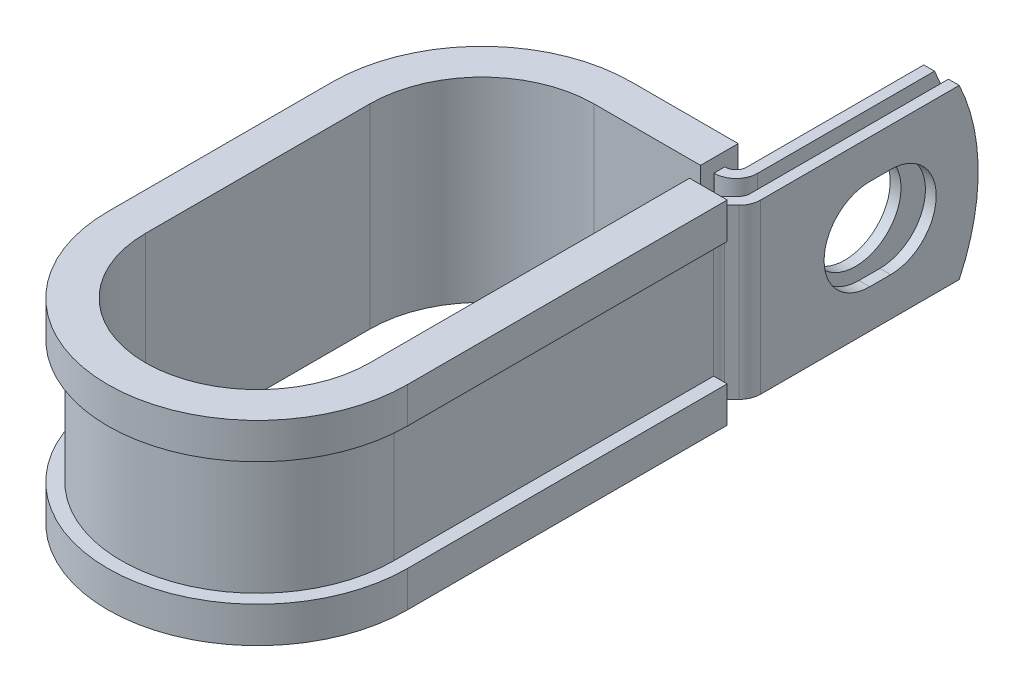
ISO-10303-21;
HEADER;
FILE_DESCRIPTION(('STEP AP214'),'2;1');
FILE_NAME('part.step','',(''),(''),'','','');
FILE_SCHEMA(('AUTOMOTIVE_DESIGN { 1 0 10303 214 1 1 1 1 }'));
ENDSEC;
DATA;
#1=APPLICATION_CONTEXT('core data for automotive mechanical design processes');
#2=APPLICATION_PROTOCOL_DEFINITION('international standard','automotive_design',2000,#1);
#3=PRODUCT_CONTEXT('',#1,'mechanical');
#4=PRODUCT('Part','Part','',(#3));
#5=PRODUCT_RELATED_PRODUCT_CATEGORY('part','',(#4));
#6=PRODUCT_DEFINITION_FORMATION('','',#4);
#7=PRODUCT_DEFINITION_CONTEXT('part definition',#1,'design');
#8=PRODUCT_DEFINITION('design','',#6,#7);
#9=PRODUCT_DEFINITION_SHAPE('','',#8);
#10=(LENGTH_UNIT() NAMED_UNIT(*) SI_UNIT(.MILLI.,.METRE.));
#11=(NAMED_UNIT(*) PLANE_ANGLE_UNIT() SI_UNIT($,.RADIAN.));
#12=(NAMED_UNIT(*) SI_UNIT($,.STERADIAN.) SOLID_ANGLE_UNIT());
#13=UNCERTAINTY_MEASURE_WITH_UNIT(LENGTH_MEASURE(1.E-05),#10,'distance_accuracy_value','');
#14=(GEOMETRIC_REPRESENTATION_CONTEXT(3) GLOBAL_UNCERTAINTY_ASSIGNED_CONTEXT((#13)) GLOBAL_UNIT_ASSIGNED_CONTEXT((#10,
#11,#12)) REPRESENTATION_CONTEXT('',''));
#15=CARTESIAN_POINT('',(0.,0.,0.));
#16=DIRECTION('',(0.,0.,1.));
#17=DIRECTION('',(1.,0.,0.));
#18=AXIS2_PLACEMENT_3D('',#15,#16,#17);
#19=CARTESIAN_POINT('',(14.9022698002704,-9.525,-14.224));
#20=DIRECTION('',(0.,1.,0.));
#21=DIRECTION('',(1.,0.,0.));
#22=AXIS2_PLACEMENT_3D('',#19,#20,#21);
#23=PLANE('',#22);
#24=DIRECTION('',(0.,0.,-1.));
#25=VECTOR('',#24,1.);
#26=CARTESIAN_POINT('',(12.0574698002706,-9.525,-14.224));
#27=LINE('',#26,#25);
#28=CARTESIAN_POINT('',(12.0574698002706,-9.525,-14.224));
#29=VERTEX_POINT('',#28);
#30=CARTESIAN_POINT('',(12.0574698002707,-9.525,-15.4432));
#31=VERTEX_POINT('',#30);
#32=EDGE_CURVE('E582',#29,#31,#27,.T.);
#33=ORIENTED_EDGE('',*,*,#32,.T.);
#34=DIRECTION('',(-1.,0.,0.));
#35=VECTOR('',#34,1.);
#36=CARTESIAN_POINT('',(0.,-9.525,-15.4432));
#37=LINE('',#36,#35);
#38=CARTESIAN_POINT('',(12.1082698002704,-9.525,-15.4432));
#39=VERTEX_POINT('',#38);
#40=EDGE_CURVE('E416',#39,#31,#37,.T.);
#41=ORIENTED_EDGE('',*,*,#40,.F.);
#42=CARTESIAN_POINT('',(12.1082698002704,-9.525,-16.6624));
#43=DIRECTION('',(0.,1.,0.));
#44=DIRECTION('',(1.,0.,0.));
#45=AXIS2_PLACEMENT_3D('',#42,#43,#44);
#46=CIRCLE('',#45,1.2192);
#47=CARTESIAN_POINT('',(13.3274698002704,-9.525,-16.6624));
#48=VERTEX_POINT('',#47);
#49=EDGE_CURVE('E414',#48,#39,#46,.F.);
#50=ORIENTED_EDGE('',*,*,#49,.F.);
#51=DIRECTION('',(0.,0.,1.));
#52=VECTOR('',#51,1.);
#53=CARTESIAN_POINT('',(13.3274698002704,-9.525,-38.862));
#54=LINE('',#53,#52);
#55=CARTESIAN_POINT('',(13.3274698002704,-9.525,-36.7174631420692));
#56=VERTEX_POINT('',#55);
#57=EDGE_CURVE('E412',#56,#48,#54,.T.);
#58=ORIENTED_EDGE('',*,*,#57,.F.);
#59=DIRECTION('',(-1.,0.,0.));
#60=VECTOR('',#59,1.);
#61=CARTESIAN_POINT('',(17.3406698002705,-9.525,-36.7174631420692));
#62=LINE('',#61,#60);
#63=CARTESIAN_POINT('',(14.5466698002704,-9.525,-36.7174631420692));
#64=VERTEX_POINT('',#63);
#65=EDGE_CURVE('E12',#64,#56,#62,.T.);
#66=ORIENTED_EDGE('',*,*,#65,.F.);
#67=DIRECTION('',(0.,0.,1.));
#68=VECTOR('',#67,1.);
#69=CARTESIAN_POINT('',(14.5466698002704,-9.525,-38.862));
#70=LINE('',#69,#68);
#71=CARTESIAN_POINT('',(14.5466698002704,-9.525,-16.6624));
#72=VERTEX_POINT('',#71);
#73=EDGE_CURVE('E410',#64,#72,#70,.T.);
#74=ORIENTED_EDGE('',*,*,#73,.T.);
#75=CARTESIAN_POINT('',(12.1082698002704,-9.525,-16.6624));
#76=DIRECTION('',(0.,-1.,0.));
#77=DIRECTION('',(0.,0.,1.));
#78=AXIS2_PLACEMENT_3D('',#75,#76,#77);
#79=CIRCLE('',#78,2.4384);
#80=CARTESIAN_POINT('',(12.1082698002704,-9.525,-14.224));
#81=VERTEX_POINT('',#80);
#82=EDGE_CURVE('E407',#72,#81,#79,.T.);
#83=ORIENTED_EDGE('',*,*,#82,.T.);
#84=DIRECTION('',(-1.,0.,0.));
#85=VECTOR('',#84,1.);
#86=CARTESIAN_POINT('',(0.,-9.525,-14.224));
#87=LINE('',#86,#85);
#88=EDGE_CURVE('E404',#81,#29,#87,.T.);
#89=ORIENTED_EDGE('',*,*,#88,.T.);
#90=EDGE_LOOP('',(#33,#41,#50,#58,#66,#74,#83,#89));
#91=FACE_BOUND('',#90,.T.);
#92=ADVANCED_FACE('F55',(#91),#23,.F.);
#93=CARTESIAN_POINT('',(14.9022698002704,9.525,-14.224));
#94=DIRECTION('',(0.,1.,0.));
#95=DIRECTION('',(1.,0.,0.));
#96=AXIS2_PLACEMENT_3D('',#93,#94,#95);
#97=PLANE('',#96);
#98=DIRECTION('',(-1.,0.,0.));
#99=VECTOR('',#98,1.);
#100=CARTESIAN_POINT('',(0.,9.525,-15.4432));
#101=LINE('',#100,#99);
#102=CARTESIAN_POINT('',(12.1082698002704,9.525,-15.4432));
#103=VERTEX_POINT('',#102);
#104=CARTESIAN_POINT('',(12.0574698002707,9.525,-15.4432));
#105=VERTEX_POINT('',#104);
#106=EDGE_CURVE('E377',#103,#105,#101,.T.);
#107=ORIENTED_EDGE('',*,*,#106,.T.);
#108=DIRECTION('',(0.,0.,1.));
#109=VECTOR('',#108,1.);
#110=CARTESIAN_POINT('',(12.0574698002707,9.525,-15.4432));
#111=LINE('',#110,#109);
#112=CARTESIAN_POINT('',(12.0574698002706,9.525,-14.224));
#113=VERTEX_POINT('',#112);
#114=EDGE_CURVE('E588',#105,#113,#111,.T.);
#115=ORIENTED_EDGE('',*,*,#114,.T.);
#116=DIRECTION('',(-1.,0.,0.));
#117=VECTOR('',#116,1.);
#118=CARTESIAN_POINT('',(0.,9.525,-14.224));
#119=LINE('',#118,#117);
#120=CARTESIAN_POINT('',(12.1082698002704,9.525,-14.224));
#121=VERTEX_POINT('',#120);
#122=EDGE_CURVE('E479',#121,#113,#119,.T.);
#123=ORIENTED_EDGE('',*,*,#122,.F.);
#124=CARTESIAN_POINT('',(12.1082698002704,9.525,-16.6624));
#125=DIRECTION('',(0.,-1.,0.));
#126=DIRECTION('',(0.,0.,1.));
#127=AXIS2_PLACEMENT_3D('',#124,#125,#126);
#128=CIRCLE('',#127,2.4384);
#129=CARTESIAN_POINT('',(14.5466698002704,9.525,-16.6624));
#130=VERTEX_POINT('',#129);
#131=EDGE_CURVE('E474',#130,#121,#128,.T.);
#132=ORIENTED_EDGE('',*,*,#131,.F.);
#133=DIRECTION('',(0.,0.,1.));
#134=VECTOR('',#133,1.);
#135=CARTESIAN_POINT('',(14.5466698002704,9.525,-38.862));
#136=LINE('',#135,#134);
#137=CARTESIAN_POINT('',(14.5466698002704,9.525,-36.7174631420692));
#138=VERTEX_POINT('',#137);
#139=EDGE_CURVE('E468',#138,#130,#136,.T.);
#140=ORIENTED_EDGE('',*,*,#139,.F.);
#141=DIRECTION('',(-1.,0.,0.));
#142=VECTOR('',#141,1.);
#143=CARTESIAN_POINT('',(17.3406698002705,9.525,-36.7174631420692));
#144=LINE('',#143,#142);
#145=CARTESIAN_POINT('',(13.3274698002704,9.525,-36.7174631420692));
#146=VERTEX_POINT('',#145);
#147=EDGE_CURVE('E63',#138,#146,#144,.T.);
#148=ORIENTED_EDGE('',*,*,#147,.T.);
#149=DIRECTION('',(0.,0.,1.));
#150=VECTOR('',#149,1.);
#151=CARTESIAN_POINT('',(13.3274698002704,9.525,-38.862));
#152=LINE('',#151,#150);
#153=CARTESIAN_POINT('',(13.3274698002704,9.525,-16.6624));
#154=VERTEX_POINT('',#153);
#155=EDGE_CURVE('E465',#146,#154,#152,.T.);
#156=ORIENTED_EDGE('',*,*,#155,.T.);
#157=CARTESIAN_POINT('',(12.1082698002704,9.525,-16.6624));
#158=DIRECTION('',(0.,1.,0.));
#159=DIRECTION('',(1.,0.,0.));
#160=AXIS2_PLACEMENT_3D('',#157,#158,#159);
#161=CIRCLE('',#160,1.2192);
#162=EDGE_CURVE('E382',#154,#103,#161,.F.);
#163=ORIENTED_EDGE('',*,*,#162,.T.);
#164=EDGE_LOOP('',(#107,#115,#123,#132,#140,#148,#156,#163));
#165=FACE_BOUND('',#164,.T.);
#166=ADVANCED_FACE('F464',(#165),#97,.T.);
#167=CARTESIAN_POINT('',(0.,9.525,-14.224));
#168=DIRECTION('',(0.,0.,1.));
#169=DIRECTION('',(1.,0.,0.));
#170=AXIS2_PLACEMENT_3D('',#167,#168,#169);
#171=PLANE('',#170);
#172=ORIENTED_EDGE('',*,*,#122,.T.);
#173=DIRECTION('',(0.,-1.,0.));
#174=VECTOR('',#173,1.);
#175=CARTESIAN_POINT('',(12.0574698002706,9.525,-14.224));
#176=LINE('',#175,#174);
#177=EDGE_CURVE('E585',#113,#29,#176,.T.);
#178=ORIENTED_EDGE('',*,*,#177,.T.);
#179=ORIENTED_EDGE('',*,*,#88,.F.);
#180=DIRECTION('',(0.,-1.,0.));
#181=VECTOR('',#180,1.);
#182=CARTESIAN_POINT('',(12.1082698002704,9.525,-14.224));
#183=LINE('',#182,#181);
#184=EDGE_CURVE('E452',#121,#81,#183,.T.);
#185=ORIENTED_EDGE('',*,*,#184,.F.);
#186=EDGE_LOOP('',(#172,#178,#179,#185));
#187=FACE_BOUND('',#186,.T.);
#188=ADVANCED_FACE('F789',(#187),#171,.T.);
#189=CARTESIAN_POINT('',(17.3406698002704,9.525,-14.224));
#190=DIRECTION('',(-1.,0.,0.));
#191=DIRECTION('',(0.,0.,1.));
#192=AXIS2_PLACEMENT_3D('',#189,#190,#191);
#193=PLANE('',#192);
#194=CARTESIAN_POINT('',(17.3406698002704,0.,-28.9559999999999));
#195=DIRECTION('',(1.,0.,0.));
#196=DIRECTION('',(0.,0.,-1.));
#197=AXIS2_PLACEMENT_3D('',#194,#195,#196);
#198=CIRCLE('',#197,5.1562);
#199=CARTESIAN_POINT('',(17.3406698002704,-5.1562,-28.9560000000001));
#200=VERTEX_POINT('',#199);
#201=CARTESIAN_POINT('',(17.3406698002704,5.1562,-28.9560000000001));
#202=VERTEX_POINT('',#201);
#203=EDGE_CURVE('E527',#200,#202,#198,.T.);
#204=ORIENTED_EDGE('',*,*,#203,.F.);
#205=DIRECTION('',(0.,0.,-1.));
#206=VECTOR('',#205,1.);
#207=CARTESIAN_POINT('',(17.3406698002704,-5.1562,-26.5683999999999));
#208=LINE('',#207,#206);
#209=CARTESIAN_POINT('',(17.3406698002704,-5.1562,-26.5683999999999));
#210=VERTEX_POINT('',#209);
#211=EDGE_CURVE('E524',#210,#200,#208,.T.);
#212=ORIENTED_EDGE('',*,*,#211,.F.);
#213=CARTESIAN_POINT('',(17.3406698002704,0.,-26.5683999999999));
#214=DIRECTION('',(1.,0.,0.));
#215=DIRECTION('',(0.,0.,-1.));
#216=AXIS2_PLACEMENT_3D('',#213,#214,#215);
#217=CIRCLE('',#216,5.1562);
#218=CARTESIAN_POINT('',(17.3406698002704,5.1562,-26.5683999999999));
#219=VERTEX_POINT('',#218);
#220=EDGE_CURVE('E521',#219,#210,#217,.T.);
#221=ORIENTED_EDGE('',*,*,#220,.F.);
#222=DIRECTION('',(0.,0.,1.));
#223=VECTOR('',#222,1.);
#224=CARTESIAN_POINT('',(17.3406698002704,5.1562,-26.5683999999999));
#225=LINE('',#224,#223);
#226=EDGE_CURVE('E520',#202,#219,#225,.T.);
#227=ORIENTED_EDGE('',*,*,#226,.F.);
#228=EDGE_LOOP('',(#204,#212,#221,#227));
#229=FACE_BOUND('',#228,.T.);
#230=DIRECTION('',(0.,0.,-1.));
#231=VECTOR('',#230,1.);
#232=CARTESIAN_POINT('',(17.3406698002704,-9.525,-14.224));
#233=LINE('',#232,#231);
#234=CARTESIAN_POINT('',(17.3406698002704,-9.525,-14.224));
#235=VERTEX_POINT('',#234);
#236=CARTESIAN_POINT('',(17.3406698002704,-9.525,-36.7174631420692));
#237=VERTEX_POINT('',#236);
#238=EDGE_CURVE('E388',#235,#237,#233,.T.);
#239=ORIENTED_EDGE('',*,*,#238,.T.);
#240=CARTESIAN_POINT('',(17.3406698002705,0.,-16.637));
#241=DIRECTION('',(-1.,0.,0.));
#242=DIRECTION('',(0.,0.,1.));
#243=AXIS2_PLACEMENT_3D('',#240,#241,#242);
#244=CIRCLE('',#243,22.225);
#245=CARTESIAN_POINT('',(17.3406698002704,9.525,-36.7174631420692));
#246=VERTEX_POINT('',#245);
#247=EDGE_CURVE('E536',#246,#237,#244,.T.);
#248=ORIENTED_EDGE('',*,*,#247,.F.);
#249=DIRECTION('',(0.,0.,-1.));
#250=VECTOR('',#249,1.);
#251=CARTESIAN_POINT('',(17.3406698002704,9.525,-14.224));
#252=LINE('',#251,#250);
#253=CARTESIAN_POINT('',(17.3406698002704,9.525,-14.224));
#254=VERTEX_POINT('',#253);
#255=EDGE_CURVE('E425',#254,#246,#252,.T.);
#256=ORIENTED_EDGE('',*,*,#255,.F.);
#257=DIRECTION('',(0.,-1.,0.));
#258=VECTOR('',#257,1.);
#259=CARTESIAN_POINT('',(17.3406698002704,9.525,-14.224));
#260=LINE('',#259,#258);
#261=EDGE_CURVE('E387',#254,#235,#260,.T.);
#262=ORIENTED_EDGE('',*,*,#261,.T.);
#263=EDGE_LOOP('',(#239,#248,#256,#262));
#264=FACE_BOUND('',#263,.T.);
#265=ADVANCED_FACE('F57',(#229,#264),#193,.F.);
#266=CARTESIAN_POINT('',(16.1214698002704,9.525,-14.224));
#267=DIRECTION('',(-1.,0.,0.));
#268=DIRECTION('',(0.,0.,1.));
#269=AXIS2_PLACEMENT_3D('',#266,#267,#268);
#270=PLANE('',#269);
#271=DIRECTION('',(0.,0.,-1.));
#272=VECTOR('',#271,1.);
#273=CARTESIAN_POINT('',(16.1214698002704,-5.1562,-26.5683999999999));
#274=LINE('',#273,#272);
#275=CARTESIAN_POINT('',(16.1214698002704,-5.1562,-26.5683999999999));
#276=VERTEX_POINT('',#275);
#277=CARTESIAN_POINT('',(16.1214698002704,-5.1562,-28.9560000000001));
#278=VERTEX_POINT('',#277);
#279=EDGE_CURVE('E505',#276,#278,#274,.T.);
#280=ORIENTED_EDGE('',*,*,#279,.T.);
#281=CARTESIAN_POINT('',(16.1214698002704,0.,-28.9559999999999));
#282=DIRECTION('',(-1.,0.,0.));
#283=DIRECTION('',(0.,0.,1.));
#284=AXIS2_PLACEMENT_3D('',#281,#282,#283);
#285=CIRCLE('',#284,5.1562);
#286=CARTESIAN_POINT('',(16.1214698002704,5.1562,-28.9560000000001));
#287=VERTEX_POINT('',#286);
#288=EDGE_CURVE('E504',#278,#287,#285,.F.);
#289=ORIENTED_EDGE('',*,*,#288,.T.);
#290=DIRECTION('',(0.,0.,1.));
#291=VECTOR('',#290,1.);
#292=CARTESIAN_POINT('',(16.1214698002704,5.1562,-26.5683999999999));
#293=LINE('',#292,#291);
#294=CARTESIAN_POINT('',(16.1214698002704,5.1562,-26.5683999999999));
#295=VERTEX_POINT('',#294);
#296=EDGE_CURVE('E508',#287,#295,#293,.T.);
#297=ORIENTED_EDGE('',*,*,#296,.T.);
#298=CARTESIAN_POINT('',(16.1214698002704,0.,-26.5683999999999));
#299=DIRECTION('',(-1.,0.,0.));
#300=DIRECTION('',(0.,0.,1.));
#301=AXIS2_PLACEMENT_3D('',#298,#299,#300);
#302=CIRCLE('',#301,5.1562);
#303=EDGE_CURVE('E501',#295,#276,#302,.F.);
#304=ORIENTED_EDGE('',*,*,#303,.T.);
#305=EDGE_LOOP('',(#280,#289,#297,#304));
#306=FACE_BOUND('',#305,.T.);
#307=CARTESIAN_POINT('',(16.1214698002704,0.,-16.637));
#308=DIRECTION('',(-1.,0.,0.));
#309=DIRECTION('',(0.,0.,1.));
#310=AXIS2_PLACEMENT_3D('',#307,#308,#309);
#311=CIRCLE('',#310,22.225);
#312=CARTESIAN_POINT('',(16.1214698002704,9.525,-36.7174631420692));
#313=VERTEX_POINT('',#312);
#314=CARTESIAN_POINT('',(16.1214698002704,-9.525,-36.7174631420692));
#315=VERTEX_POINT('',#314);
#316=EDGE_CURVE('E77',#313,#315,#311,.T.);
#317=ORIENTED_EDGE('',*,*,#316,.T.);
#318=DIRECTION('',(0.,0.,-1.));
#319=VECTOR('',#318,1.);
#320=CARTESIAN_POINT('',(16.1214698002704,-9.525,-14.224));
#321=LINE('',#320,#319);
#322=CARTESIAN_POINT('',(16.1214698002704,-9.525,-14.224));
#323=VERTEX_POINT('',#322);
#324=EDGE_CURVE('E391',#323,#315,#321,.T.);
#325=ORIENTED_EDGE('',*,*,#324,.F.);
#326=DIRECTION('',(0.,-1.,0.));
#327=VECTOR('',#326,1.);
#328=CARTESIAN_POINT('',(16.1214698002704,9.525,-14.224));
#329=LINE('',#328,#327);
#330=CARTESIAN_POINT('',(16.1214698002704,9.525,-14.224));
#331=VERTEX_POINT('',#330);
#332=EDGE_CURVE('E460',#331,#323,#329,.T.);
#333=ORIENTED_EDGE('',*,*,#332,.F.);
#334=DIRECTION('',(0.,0.,-1.));
#335=VECTOR('',#334,1.);
#336=CARTESIAN_POINT('',(16.1214698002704,9.525,-14.224));
#337=LINE('',#336,#335);
#338=EDGE_CURVE('E489',#331,#313,#337,.T.);
#339=ORIENTED_EDGE('',*,*,#338,.T.);
#340=EDGE_LOOP('',(#317,#325,#333,#339));
#341=FACE_BOUND('',#340,.T.);
#342=ADVANCED_FACE('F762',(#306,#341),#270,.T.);
#343=CARTESIAN_POINT('',(14.5466698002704,9.525,-38.862));
#344=DIRECTION('',(1.,0.,0.));
#345=DIRECTION('',(0.,0.,-1.));
#346=AXIS2_PLACEMENT_3D('',#343,#344,#345);
#347=PLANE('',#346);
#348=CARTESIAN_POINT('',(14.5466698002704,0.,-27.7622));
#349=DIRECTION('',(1.,0.,0.));
#350=DIRECTION('',(0.,0.,-1.));
#351=AXIS2_PLACEMENT_3D('',#348,#349,#350);
#352=CIRCLE('',#351,5.1562);
#353=CARTESIAN_POINT('',(14.5466698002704,0.,-32.9184));
#354=VERTEX_POINT('',#353);
#355=EDGE_CURVE('E392',#354,#354,#352,.F.);
#356=ORIENTED_EDGE('',*,*,#355,.T.);
#357=EDGE_LOOP('',(#356));
#358=FACE_BOUND('',#357,.T.);
#359=ORIENTED_EDGE('',*,*,#73,.F.);
#360=CARTESIAN_POINT('',(14.5466698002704,0.,-16.637));
#361=DIRECTION('',(1.,0.,0.));
#362=DIRECTION('',(0.,0.,-1.));
#363=AXIS2_PLACEMENT_3D('',#360,#361,#362);
#364=CIRCLE('',#363,22.225);
#365=EDGE_CURVE('E532',#64,#138,#364,.T.);
#366=ORIENTED_EDGE('',*,*,#365,.T.);
#367=ORIENTED_EDGE('',*,*,#139,.T.);
#368=DIRECTION('',(0.,-1.,0.));
#369=VECTOR('',#368,1.);
#370=CARTESIAN_POINT('',(14.5466698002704,9.525,-16.6624));
#371=LINE('',#370,#369);
#372=EDGE_CURVE('E449',#130,#72,#371,.T.);
#373=ORIENTED_EDGE('',*,*,#372,.T.);
#374=EDGE_LOOP('',(#359,#366,#367,#373));
#375=FACE_BOUND('',#374,.T.);
#376=ADVANCED_FACE('F797',(#358,#375),#347,.T.);
#377=CARTESIAN_POINT('',(13.3274698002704,9.525,-38.862));
#378=DIRECTION('',(1.,0.,0.));
#379=DIRECTION('',(0.,0.,-1.));
#380=AXIS2_PLACEMENT_3D('',#377,#378,#379);
#381=PLANE('',#380);
#382=CARTESIAN_POINT('',(13.3274698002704,0.,-27.7622));
#383=DIRECTION('',(-1.,0.,0.));
#384=DIRECTION('',(0.,0.,1.));
#385=AXIS2_PLACEMENT_3D('',#382,#383,#384);
#386=CIRCLE('',#385,5.1562);
#387=CARTESIAN_POINT('',(13.3274698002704,0.,-22.606));
#388=VERTEX_POINT('',#387);
#389=EDGE_CURVE('E496',#388,#388,#386,.T.);
#390=ORIENTED_EDGE('',*,*,#389,.F.);
#391=EDGE_LOOP('',(#390));
#392=FACE_BOUND('',#391,.T.);
#393=CARTESIAN_POINT('',(13.3274698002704,0.,-16.637));
#394=DIRECTION('',(-1.,0.,0.));
#395=DIRECTION('',(0.,0.,1.));
#396=AXIS2_PLACEMENT_3D('',#393,#394,#395);
#397=CIRCLE('',#396,22.225);
#398=EDGE_CURVE('E69',#146,#56,#397,.T.);
#399=ORIENTED_EDGE('',*,*,#398,.T.);
#400=ORIENTED_EDGE('',*,*,#57,.T.);
#401=DIRECTION('',(0.,-1.,0.));
#402=VECTOR('',#401,1.);
#403=CARTESIAN_POINT('',(13.3274698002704,9.525,-16.6624));
#404=LINE('',#403,#402);
#405=EDGE_CURVE('E446',#154,#48,#404,.T.);
#406=ORIENTED_EDGE('',*,*,#405,.F.);
#407=ORIENTED_EDGE('',*,*,#155,.F.);
#408=EDGE_LOOP('',(#399,#400,#406,#407));
#409=FACE_BOUND('',#408,.T.);
#410=ADVANCED_FACE('F471',(#392,#409),#381,.F.);
#411=CARTESIAN_POINT('',(16.6624,-9.525,-10.8115026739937));
#412=DIRECTION('',(0.,1.,0.));
#413=DIRECTION('',(1.,0.,0.));
#414=AXIS2_PLACEMENT_3D('',#411,#412,#413);
#415=CIRCLE('',#414,1.2192);
#416=CARTESIAN_POINT('',(15.4432,-9.525,-10.8115026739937));
#417=VERTEX_POINT('',#416);
#418=CARTESIAN_POINT('',(15.8002954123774,-9.525,-11.6736072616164));
#419=VERTEX_POINT('',#418);
#420=EDGE_CURVE('E419',#417,#419,#415,.F.);
#421=ORIENTED_EDGE('',*,*,#420,.F.);
#422=DIRECTION('',(1.,0.,0.));
#423=VECTOR('',#422,1.);
#424=CARTESIAN_POINT('',(14.224,-9.525,-10.8115026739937));
#425=LINE('',#424,#423);
#426=CARTESIAN_POINT('',(14.224,-9.525,-10.8115026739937));
#427=VERTEX_POINT('',#426);
#428=EDGE_CURVE('E370',#427,#417,#425,.T.);
#429=ORIENTED_EDGE('',*,*,#428,.F.);
#430=CARTESIAN_POINT('',(16.6624,-9.525,-10.8115026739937));
#431=DIRECTION('',(0.,-1.,0.));
#432=DIRECTION('',(0.,0.,1.));
#433=AXIS2_PLACEMENT_3D('',#430,#431,#432);
#434=CIRCLE('',#433,2.4384);
#435=CARTESIAN_POINT('',(14.9381908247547,-9.525,-12.535711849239));
#436=VERTEX_POINT('',#435);
#437=EDGE_CURVE('E401',#427,#436,#434,.T.);
#438=ORIENTED_EDGE('',*,*,#437,.T.);
#439=DIRECTION('',(0.707106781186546,0.,-0.707106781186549));
#440=VECTOR('',#439,1.);
#441=CARTESIAN_POINT('',(14.9381908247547,-9.525,-12.535711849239));
#442=LINE('',#441,#440);
#443=CARTESIAN_POINT('',(15.7643743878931,-9.525,-13.3618954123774));
#444=VERTEX_POINT('',#443);
#445=EDGE_CURVE('E398',#436,#444,#442,.T.);
#446=ORIENTED_EDGE('',*,*,#445,.T.);
#447=CARTESIAN_POINT('',(14.9022698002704,-9.525,-14.224));
#448=DIRECTION('',(0.,1.,0.));
#449=DIRECTION('',(0.,0.,1.));
#450=AXIS2_PLACEMENT_3D('',#447,#448,#449);
#451=CIRCLE('',#450,1.2192);
#452=EDGE_CURVE('E395',#444,#323,#451,.T.);
#453=ORIENTED_EDGE('',*,*,#452,.T.);
#454=ORIENTED_EDGE('',*,*,#324,.T.);
#455=DIRECTION('',(-1.,0.,0.));
#456=VECTOR('',#455,1.);
#457=CARTESIAN_POINT('',(17.3406698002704,-9.525,-36.7174631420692));
#458=LINE('',#457,#456);
#459=EDGE_CURVE('E538',#237,#315,#458,.T.);
#460=ORIENTED_EDGE('',*,*,#459,.F.);
#461=ORIENTED_EDGE('',*,*,#238,.F.);
#462=CARTESIAN_POINT('',(14.9022698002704,-9.525,-14.224));
#463=DIRECTION('',(0.,1.,0.));
#464=DIRECTION('',(1.,0.,0.));
#465=AXIS2_PLACEMENT_3D('',#462,#463,#464);
#466=CIRCLE('',#465,2.4384);
#467=CARTESIAN_POINT('',(16.6264789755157,-9.525,-12.4997908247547));
#468=VERTEX_POINT('',#467);
#469=EDGE_CURVE('E423',#468,#235,#466,.T.);
#470=ORIENTED_EDGE('',*,*,#469,.F.);
#471=DIRECTION('',(0.707106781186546,0.,-0.707106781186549));
#472=VECTOR('',#471,1.);
#473=CARTESIAN_POINT('',(15.8002954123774,-9.525,-11.6736072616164));
#474=LINE('',#473,#472);
#475=EDGE_CURVE('E421',#419,#468,#474,.T.);
#476=ORIENTED_EDGE('',*,*,#475,.F.);
#477=EDGE_LOOP('',(#421,#429,#438,#446,#453,#454,#460,#461,#470,#476));
#478=FACE_BOUND('',#477,.T.);
#479=ADVANCED_FACE('F743',(#478),#23,.F.);
#480=DIRECTION('',(-1.,0.,0.));
#481=VECTOR('',#480,1.);
#482=CARTESIAN_POINT('',(15.4432,9.525,-10.8115026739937));
#483=LINE('',#482,#481);
#484=CARTESIAN_POINT('',(15.4432,9.525,-10.8115026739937));
#485=VERTEX_POINT('',#484);
#486=CARTESIAN_POINT('',(14.224,9.525,-10.8115026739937));
#487=VERTEX_POINT('',#486);
#488=EDGE_CURVE('E350',#485,#487,#483,.T.);
#489=ORIENTED_EDGE('',*,*,#488,.F.);
#490=CARTESIAN_POINT('',(16.6624,9.525,-10.8115026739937));
#491=DIRECTION('',(0.,1.,0.));
#492=DIRECTION('',(1.,0.,0.));
#493=AXIS2_PLACEMENT_3D('',#490,#491,#492);
#494=CIRCLE('',#493,1.2192);
#495=CARTESIAN_POINT('',(15.8002954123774,9.525,-11.6736072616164));
#496=VERTEX_POINT('',#495);
#497=EDGE_CURVE('E365',#485,#496,#494,.F.);
#498=ORIENTED_EDGE('',*,*,#497,.T.);
#499=DIRECTION('',(0.707106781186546,0.,-0.707106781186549));
#500=VECTOR('',#499,1.);
#501=CARTESIAN_POINT('',(15.8002954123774,9.525,-11.6736072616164));
#502=LINE('',#501,#500);
#503=CARTESIAN_POINT('',(16.6264789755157,9.525,-12.4997908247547));
#504=VERTEX_POINT('',#503);
#505=EDGE_CURVE('E376',#496,#504,#502,.T.);
#506=ORIENTED_EDGE('',*,*,#505,.T.);
#507=CARTESIAN_POINT('',(14.9022698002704,9.525,-14.224));
#508=DIRECTION('',(0.,1.,0.));
#509=DIRECTION('',(1.,0.,0.));
#510=AXIS2_PLACEMENT_3D('',#507,#508,#509);
#511=CIRCLE('',#510,2.4384);
#512=EDGE_CURVE('E379',#504,#254,#511,.T.);
#513=ORIENTED_EDGE('',*,*,#512,.T.);
#514=ORIENTED_EDGE('',*,*,#255,.T.);
#515=DIRECTION('',(-1.,0.,0.));
#516=VECTOR('',#515,1.);
#517=CARTESIAN_POINT('',(17.3406698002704,9.525,-36.7174631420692));
#518=LINE('',#517,#516);
#519=EDGE_CURVE('E534',#246,#313,#518,.T.);
#520=ORIENTED_EDGE('',*,*,#519,.T.);
#521=ORIENTED_EDGE('',*,*,#338,.F.);
#522=CARTESIAN_POINT('',(14.9022698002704,9.525,-14.224));
#523=DIRECTION('',(0.,1.,0.));
#524=DIRECTION('',(0.,0.,1.));
#525=AXIS2_PLACEMENT_3D('',#522,#523,#524);
#526=CIRCLE('',#525,1.2192);
#527=CARTESIAN_POINT('',(15.7643743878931,9.525,-13.3618954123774));
#528=VERTEX_POINT('',#527);
#529=EDGE_CURVE('E486',#528,#331,#526,.T.);
#530=ORIENTED_EDGE('',*,*,#529,.F.);
#531=DIRECTION('',(0.707106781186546,0.,-0.707106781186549));
#532=VECTOR('',#531,1.);
#533=CARTESIAN_POINT('',(14.9381908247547,9.525,-12.535711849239));
#534=LINE('',#533,#532);
#535=CARTESIAN_POINT('',(14.9381908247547,9.525,-12.535711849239));
#536=VERTEX_POINT('',#535);
#537=EDGE_CURVE('E483',#536,#528,#534,.T.);
#538=ORIENTED_EDGE('',*,*,#537,.F.);
#539=CARTESIAN_POINT('',(16.6624,9.525,-10.8115026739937));
#540=DIRECTION('',(0.,-1.,0.));
#541=DIRECTION('',(0.,0.,1.));
#542=AXIS2_PLACEMENT_3D('',#539,#540,#541);
#543=CIRCLE('',#542,2.4384);
#544=EDGE_CURVE('E369',#487,#536,#543,.T.);
#545=ORIENTED_EDGE('',*,*,#544,.F.);
#546=EDGE_LOOP('',(#489,#498,#506,#513,#514,#520,#521,#530,#538,#545));
#547=FACE_BOUND('',#546,.T.);
#548=ADVANCED_FACE('F364',(#547),#97,.T.);
#549=CARTESIAN_POINT('',(14.9022698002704,9.525,-14.224));
#550=DIRECTION('',(0.,-1.,0.));
#551=DIRECTION('',(0.,0.,-1.));
#552=AXIS2_PLACEMENT_3D('',#549,#550,#551);
#553=CYLINDRICAL_SURFACE('',#552,1.2192);
#554=ORIENTED_EDGE('',*,*,#452,.F.);
#555=DIRECTION('',(0.,-1.,0.));
#556=VECTOR('',#555,1.);
#557=CARTESIAN_POINT('',(15.7643743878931,9.525,-13.3618954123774));
#558=LINE('',#557,#556);
#559=EDGE_CURVE('E458',#528,#444,#558,.T.);
#560=ORIENTED_EDGE('',*,*,#559,.F.);
#561=ORIENTED_EDGE('',*,*,#529,.T.);
#562=ORIENTED_EDGE('',*,*,#332,.T.);
#563=EDGE_LOOP('',(#554,#560,#561,#562));
#564=FACE_BOUND('',#563,.T.);
#565=ADVANCED_FACE('F765',(#564),#553,.F.);
#566=CARTESIAN_POINT('',(14.9381908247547,9.525,-12.535711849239));
#567=DIRECTION('',(-0.707106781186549,0.,-0.707106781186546));
#568=DIRECTION('',(-0.707106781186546,0.,0.707106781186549));
#569=AXIS2_PLACEMENT_3D('',#566,#567,#568);
#570=PLANE('',#569);
#571=ORIENTED_EDGE('',*,*,#445,.F.);
#572=DIRECTION('',(0.,-1.,0.));
#573=VECTOR('',#572,1.);
#574=CARTESIAN_POINT('',(14.9381908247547,9.525,-12.535711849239));
#575=LINE('',#574,#573);
#576=EDGE_CURVE('E456',#536,#436,#575,.T.);
#577=ORIENTED_EDGE('',*,*,#576,.F.);
#578=ORIENTED_EDGE('',*,*,#537,.T.);
#579=ORIENTED_EDGE('',*,*,#559,.T.);
#580=EDGE_LOOP('',(#571,#577,#578,#579));
#581=FACE_BOUND('',#580,.T.);
#582=ADVANCED_FACE('F768',(#581),#570,.T.);
#583=CARTESIAN_POINT('',(16.6624,9.525,-10.8115026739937));
#584=DIRECTION('',(0.,-1.,0.));
#585=DIRECTION('',(0.,0.,-1.));
#586=AXIS2_PLACEMENT_3D('',#583,#584,#585);
#587=CYLINDRICAL_SURFACE('',#586,2.4384);
#588=ORIENTED_EDGE('',*,*,#437,.F.);
#589=DIRECTION('',(0.,-1.,0.));
#590=VECTOR('',#589,1.);
#591=CARTESIAN_POINT('',(14.224,9.525,-10.8115026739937));
#592=LINE('',#591,#590);
#593=EDGE_CURVE('E454',#487,#427,#592,.T.);
#594=ORIENTED_EDGE('',*,*,#593,.F.);
#595=ORIENTED_EDGE('',*,*,#544,.T.);
#596=ORIENTED_EDGE('',*,*,#576,.T.);
#597=EDGE_LOOP('',(#588,#594,#595,#596));
#598=FACE_BOUND('',#597,.T.);
#599=ADVANCED_FACE('F770',(#598),#587,.T.);
#600=CARTESIAN_POINT('',(12.1082698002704,9.525,-16.6624));
#601=DIRECTION('',(0.,-1.,0.));
#602=DIRECTION('',(0.,0.,-1.));
#603=AXIS2_PLACEMENT_3D('',#600,#601,#602);
#604=CYLINDRICAL_SURFACE('',#603,2.4384);
#605=ORIENTED_EDGE('',*,*,#82,.F.);
#606=ORIENTED_EDGE('',*,*,#372,.F.);
#607=ORIENTED_EDGE('',*,*,#131,.T.);
#608=ORIENTED_EDGE('',*,*,#184,.T.);
#609=EDGE_LOOP('',(#605,#606,#607,#608));
#610=FACE_BOUND('',#609,.T.);
#611=ADVANCED_FACE('F772',(#610),#604,.T.);
#612=CARTESIAN_POINT('',(12.1082698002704,9.525,-16.6624));
#613=DIRECTION('',(0.,-1.,0.));
#614=DIRECTION('',(0.,0.,-1.));
#615=AXIS2_PLACEMENT_3D('',#612,#613,#614);
#616=CYLINDRICAL_SURFACE('',#615,1.2192);
#617=ORIENTED_EDGE('',*,*,#49,.T.);
#618=DIRECTION('',(0.,-1.,0.));
#619=VECTOR('',#618,1.);
#620=CARTESIAN_POINT('',(12.1082698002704,9.525,-15.4432));
#621=LINE('',#620,#619);
#622=EDGE_CURVE('E443',#103,#39,#621,.T.);
#623=ORIENTED_EDGE('',*,*,#622,.F.);
#624=ORIENTED_EDGE('',*,*,#162,.F.);
#625=ORIENTED_EDGE('',*,*,#405,.T.);
#626=EDGE_LOOP('',(#617,#623,#624,#625));
#627=FACE_BOUND('',#626,.T.);
#628=ADVANCED_FACE('F778',(#627),#616,.F.);
#629=CARTESIAN_POINT('',(0.,9.525,-15.4432));
#630=DIRECTION('',(0.,0.,1.));
#631=DIRECTION('',(1.,0.,0.));
#632=AXIS2_PLACEMENT_3D('',#629,#630,#631);
#633=PLANE('',#632);
#634=DIRECTION('',(0.,-1.,0.));
#635=VECTOR('',#634,1.);
#636=CARTESIAN_POINT('',(0.,9.525,-15.4432));
#637=LINE('',#636,#635);
#638=CARTESIAN_POINT('',(2.17589166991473E-13,6.985,-15.4432));
#639=VERTEX_POINT('',#638);
#640=CARTESIAN_POINT('',(2.17589166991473E-13,-6.985,-15.4432));
#641=VERTEX_POINT('',#640);
#642=EDGE_CURVE('E440',#639,#641,#637,.T.);
#643=ORIENTED_EDGE('',*,*,#642,.F.);
#644=DIRECTION('',(1.,0.,0.));
#645=VECTOR('',#644,1.);
#646=CARTESIAN_POINT('',(2.17589166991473E-13,6.985,-15.4432));
#647=LINE('',#646,#645);
#648=CARTESIAN_POINT('',(12.0574698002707,6.985,-15.4432));
#649=VERTEX_POINT('',#648);
#650=EDGE_CURVE('E541',#639,#649,#647,.T.);
#651=ORIENTED_EDGE('',*,*,#650,.T.);
#652=DIRECTION('',(0.,1.,0.));
#653=VECTOR('',#652,1.);
#654=CARTESIAN_POINT('',(12.0574698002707,9.525,-15.4432));
#655=LINE('',#654,#653);
#656=EDGE_CURVE('E591',#649,#105,#655,.T.);
#657=ORIENTED_EDGE('',*,*,#656,.T.);
#658=ORIENTED_EDGE('',*,*,#106,.F.);
#659=ORIENTED_EDGE('',*,*,#622,.T.);
#660=ORIENTED_EDGE('',*,*,#40,.T.);
#661=DIRECTION('',(0.,1.,0.));
#662=VECTOR('',#661,1.);
#663=CARTESIAN_POINT('',(12.0574698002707,-9.525,-15.4432));
#664=LINE('',#663,#662);
#665=CARTESIAN_POINT('',(12.0574698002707,-6.985,-15.4432));
#666=VERTEX_POINT('',#665);
#667=EDGE_CURVE('E579',#31,#666,#664,.T.);
#668=ORIENTED_EDGE('',*,*,#667,.T.);
#669=DIRECTION('',(1.,0.,0.));
#670=VECTOR('',#669,1.);
#671=CARTESIAN_POINT('',(2.17589166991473E-13,-6.985,-15.4432));
#672=LINE('',#671,#670);
#673=EDGE_CURVE('E562',#641,#666,#672,.T.);
#674=ORIENTED_EDGE('',*,*,#673,.F.);
#675=EDGE_LOOP('',(#643,#651,#657,#658,#659,#660,#668,#674));
#676=FACE_BOUND('',#675,.T.);
#677=ADVANCED_FACE('F830',(#676),#633,.F.);
#678=CARTESIAN_POINT('',(0.,9.525,0.));
#679=DIRECTION('',(0.,-1.,0.));
#680=DIRECTION('',(0.,0.,-1.));
#681=AXIS2_PLACEMENT_3D('',#678,#679,#680);
#682=CYLINDRICAL_SURFACE('',#681,15.4432);
#683=DIRECTION('',(0.,-1.,0.));
#684=VECTOR('',#683,1.);
#685=CARTESIAN_POINT('',(-15.4432,9.525,0.));
#686=LINE('',#685,#684);
#687=CARTESIAN_POINT('',(-15.4432,6.985,-2.15105711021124E-13));
#688=VERTEX_POINT('',#687);
#689=CARTESIAN_POINT('',(-15.4432,-6.985,-2.15105711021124E-13));
#690=VERTEX_POINT('',#689);
#691=EDGE_CURVE('E437',#688,#690,#686,.T.);
#692=ORIENTED_EDGE('',*,*,#691,.F.);
#693=CARTESIAN_POINT('',(0.,6.985,0.));
#694=DIRECTION('',(0.,-1.,0.));
#695=DIRECTION('',(0.,0.,-1.));
#696=AXIS2_PLACEMENT_3D('',#693,#694,#695);
#697=CIRCLE('',#696,15.4432);
#698=EDGE_CURVE('E594',#688,#639,#697,.T.);
#699=ORIENTED_EDGE('',*,*,#698,.T.);
#700=ORIENTED_EDGE('',*,*,#642,.T.);
#701=CARTESIAN_POINT('',(0.,-6.985,0.));
#702=DIRECTION('',(0.,-1.,0.));
#703=DIRECTION('',(0.,0.,-1.));
#704=AXIS2_PLACEMENT_3D('',#701,#702,#703);
#705=CIRCLE('',#704,15.4432);
#706=EDGE_CURVE('E615',#690,#641,#705,.T.);
#707=ORIENTED_EDGE('',*,*,#706,.F.);
#708=EDGE_LOOP('',(#692,#699,#700,#707));
#709=FACE_BOUND('',#708,.T.);
#710=ADVANCED_FACE('F841',(#709),#682,.T.);
#711=CARTESIAN_POINT('',(-15.4432,9.525,0.));
#712=DIRECTION('',(1.,0.,0.));
#713=DIRECTION('',(0.,0.,-1.));
#714=AXIS2_PLACEMENT_3D('',#711,#712,#713);
#715=PLANE('',#714);
#716=DIRECTION('',(0.,-1.,0.));
#717=VECTOR('',#716,1.);
#718=CARTESIAN_POINT('',(-15.4432,9.525,25.4));
#719=LINE('',#718,#717);
#720=CARTESIAN_POINT('',(-15.4432,6.985,25.3999999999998));
#721=VERTEX_POINT('',#720);
#722=CARTESIAN_POINT('',(-15.4432,-6.985,25.3999999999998));
#723=VERTEX_POINT('',#722);
#724=EDGE_CURVE('E434',#721,#723,#719,.T.);
#725=ORIENTED_EDGE('',*,*,#724,.F.);
#726=DIRECTION('',(0.,0.,-1.));
#727=VECTOR('',#726,1.);
#728=CARTESIAN_POINT('',(-15.4432,6.985,25.3999999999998));
#729=LINE('',#728,#727);
#730=EDGE_CURVE('E626',#721,#688,#729,.T.);
#731=ORIENTED_EDGE('',*,*,#730,.T.);
#732=ORIENTED_EDGE('',*,*,#691,.T.);
#733=DIRECTION('',(0.,0.,-1.));
#734=VECTOR('',#733,1.);
#735=CARTESIAN_POINT('',(-15.4432,-6.985,25.3999999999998));
#736=LINE('',#735,#734);
#737=EDGE_CURVE('E647',#723,#690,#736,.T.);
#738=ORIENTED_EDGE('',*,*,#737,.F.);
#739=EDGE_LOOP('',(#725,#731,#732,#738));
#740=FACE_BOUND('',#739,.T.);
#741=ADVANCED_FACE('F846',(#740),#715,.F.);
#742=CARTESIAN_POINT('',(0.,9.525,25.4));
#743=DIRECTION('',(0.,-1.,0.));
#744=DIRECTION('',(0.,0.,-1.));
#745=AXIS2_PLACEMENT_3D('',#742,#743,#744);
#746=CYLINDRICAL_SURFACE('',#745,15.4432);
#747=DIRECTION('',(0.,-1.,0.));
#748=VECTOR('',#747,1.);
#749=CARTESIAN_POINT('',(15.4432,9.525,25.4));
#750=LINE('',#749,#748);
#751=CARTESIAN_POINT('',(15.4432,6.985,25.4));
#752=VERTEX_POINT('',#751);
#753=CARTESIAN_POINT('',(15.4432,-6.985,25.4));
#754=VERTEX_POINT('',#753);
#755=EDGE_CURVE('E359',#752,#754,#750,.T.);
#756=ORIENTED_EDGE('',*,*,#755,.F.);
#757=CARTESIAN_POINT('',(0.,6.985,25.4));
#758=DIRECTION('',(0.,-1.,0.));
#759=DIRECTION('',(0.,0.,-1.));
#760=AXIS2_PLACEMENT_3D('',#757,#758,#759);
#761=CIRCLE('',#760,15.4432);
#762=EDGE_CURVE('E658',#752,#721,#761,.T.);
#763=ORIENTED_EDGE('',*,*,#762,.T.);
#764=ORIENTED_EDGE('',*,*,#724,.T.);
#765=CARTESIAN_POINT('',(0.,-6.985,25.4));
#766=DIRECTION('',(0.,-1.,0.));
#767=DIRECTION('',(0.,0.,-1.));
#768=AXIS2_PLACEMENT_3D('',#765,#766,#767);
#769=CIRCLE('',#768,15.4432);
#770=EDGE_CURVE('E679',#754,#723,#769,.T.);
#771=ORIENTED_EDGE('',*,*,#770,.F.);
#772=EDGE_LOOP('',(#756,#763,#764,#771));
#773=FACE_BOUND('',#772,.T.);
#774=ADVANCED_FACE('F851',(#773),#746,.T.);
#775=CARTESIAN_POINT('',(15.4432,9.525,0.));
#776=DIRECTION('',(-1.,0.,0.));
#777=DIRECTION('',(0.,0.,1.));
#778=AXIS2_PLACEMENT_3D('',#775,#776,#777);
#779=PLANE('',#778);
#780=DIRECTION('',(0.,-1.,0.));
#781=VECTOR('',#780,1.);
#782=CARTESIAN_POINT('',(15.4432,9.525,-10.8115026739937));
#783=LINE('',#782,#781);
#784=CARTESIAN_POINT('',(15.4432,6.985,-10.8115026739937));
#785=VERTEX_POINT('',#784);
#786=CARTESIAN_POINT('',(15.4432,-6.985,-10.8115026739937));
#787=VERTEX_POINT('',#786);
#788=EDGE_CURVE('E360',#785,#787,#783,.T.);
#789=ORIENTED_EDGE('',*,*,#788,.F.);
#790=DIRECTION('',(0.,0.,-1.));
#791=VECTOR('',#790,1.);
#792=CARTESIAN_POINT('',(15.4432,6.985,0.));
#793=LINE('',#792,#791);
#794=EDGE_CURVE('E699',#752,#785,#793,.T.);
#795=ORIENTED_EDGE('',*,*,#794,.F.);
#796=ORIENTED_EDGE('',*,*,#755,.T.);
#797=DIRECTION('',(0.,0.,-1.));
#798=VECTOR('',#797,1.);
#799=CARTESIAN_POINT('',(15.4432,-6.985,0.));
#800=LINE('',#799,#798);
#801=EDGE_CURVE('E700',#754,#787,#800,.T.);
#802=ORIENTED_EDGE('',*,*,#801,.T.);
#803=EDGE_LOOP('',(#789,#795,#796,#802));
#804=FACE_BOUND('',#803,.T.);
#805=ADVANCED_FACE('F854',(#804),#779,.F.);
#806=CARTESIAN_POINT('',(16.6624,9.525,-10.8115026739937));
#807=DIRECTION('',(0.,-1.,0.));
#808=DIRECTION('',(0.,0.,-1.));
#809=AXIS2_PLACEMENT_3D('',#806,#807,#808);
#810=CYLINDRICAL_SURFACE('',#809,1.2192);
#811=ORIENTED_EDGE('',*,*,#420,.T.);
#812=DIRECTION('',(0.,-1.,0.));
#813=VECTOR('',#812,1.);
#814=CARTESIAN_POINT('',(15.8002954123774,9.525,-11.6736072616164));
#815=LINE('',#814,#813);
#816=EDGE_CURVE('E374',#496,#419,#815,.T.);
#817=ORIENTED_EDGE('',*,*,#816,.F.);
#818=ORIENTED_EDGE('',*,*,#497,.F.);
#819=EDGE_CURVE('E347',#485,#785,#783,.T.);
#820=ORIENTED_EDGE('',*,*,#819,.T.);
#821=ORIENTED_EDGE('',*,*,#788,.T.);
#822=DIRECTION('',(0.,1.,0.));
#823=VECTOR('',#822,1.);
#824=CARTESIAN_POINT('',(15.4432,-9.525,-10.8115026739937));
#825=LINE('',#824,#823);
#826=EDGE_CURVE('E734',#417,#787,#825,.T.);
#827=ORIENTED_EDGE('',*,*,#826,.F.);
#828=EDGE_LOOP('',(#811,#817,#818,#820,#821,#827));
#829=FACE_BOUND('',#828,.T.);
#830=ADVANCED_FACE('F372',(#829),#810,.F.);
#831=CARTESIAN_POINT('',(15.8002954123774,9.525,-11.6736072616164));
#832=DIRECTION('',(-0.707106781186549,0.,-0.707106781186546));
#833=DIRECTION('',(-0.707106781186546,0.,0.707106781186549));
#834=AXIS2_PLACEMENT_3D('',#831,#832,#833);
#835=PLANE('',#834);
#836=ORIENTED_EDGE('',*,*,#475,.T.);
#837=DIRECTION('',(0.,-1.,0.));
#838=VECTOR('',#837,1.);
#839=CARTESIAN_POINT('',(16.6264789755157,9.525,-12.4997908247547));
#840=LINE('',#839,#838);
#841=EDGE_CURVE('E428',#504,#468,#840,.T.);
#842=ORIENTED_EDGE('',*,*,#841,.F.);
#843=ORIENTED_EDGE('',*,*,#505,.F.);
#844=ORIENTED_EDGE('',*,*,#816,.T.);
#845=EDGE_LOOP('',(#836,#842,#843,#844));
#846=FACE_BOUND('',#845,.T.);
#847=ADVANCED_FACE('F748',(#846),#835,.F.);
#848=CARTESIAN_POINT('',(14.9022698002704,9.525,-14.224));
#849=DIRECTION('',(0.,-1.,0.));
#850=DIRECTION('',(0.,0.,-1.));
#851=AXIS2_PLACEMENT_3D('',#848,#849,#850);
#852=CYLINDRICAL_SURFACE('',#851,2.4384);
#853=ORIENTED_EDGE('',*,*,#469,.T.);
#854=ORIENTED_EDGE('',*,*,#261,.F.);
#855=ORIENTED_EDGE('',*,*,#512,.F.);
#856=ORIENTED_EDGE('',*,*,#841,.T.);
#857=EDGE_LOOP('',(#853,#854,#855,#856));
#858=FACE_BOUND('',#857,.T.);
#859=ADVANCED_FACE('F751',(#858),#852,.T.);
#860=CARTESIAN_POINT('',(29.1306057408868,0.,-27.7622));
#861=DIRECTION('',(-1.,0.,0.));
#862=DIRECTION('',(0.,0.,1.));
#863=AXIS2_PLACEMENT_3D('',#860,#861,#862);
#864=CYLINDRICAL_SURFACE('',#863,5.1562);
#865=ORIENTED_EDGE('',*,*,#389,.T.);
#866=EDGE_LOOP('',(#865));
#867=FACE_BOUND('',#866,.T.);
#868=ORIENTED_EDGE('',*,*,#355,.F.);
#869=EDGE_LOOP('',(#868));
#870=FACE_BOUND('',#869,.T.);
#871=ADVANCED_FACE('F965',(#867,#870),#864,.F.);
#872=CARTESIAN_POINT('',(-0.238102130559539,-5.1562,-26.5683999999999));
#873=DIRECTION('',(0.,-1.,0.));
#874=DIRECTION('',(0.,0.,-1.));
#875=AXIS2_PLACEMENT_3D('',#872,#873,#874);
#876=PLANE('',#875);
#877=DIRECTION('',(1.,0.,0.));
#878=VECTOR('',#877,1.);
#879=CARTESIAN_POINT('',(-0.238102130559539,-5.1562,-26.5683999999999));
#880=LINE('',#879,#878);
#881=EDGE_CURVE('E499',#276,#210,#880,.T.);
#882=ORIENTED_EDGE('',*,*,#881,.T.);
#883=ORIENTED_EDGE('',*,*,#211,.T.);
#884=DIRECTION('',(1.,0.,0.));
#885=VECTOR('',#884,1.);
#886=CARTESIAN_POINT('',(-0.238102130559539,-5.1562,-28.9560000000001));
#887=LINE('',#886,#885);
#888=EDGE_CURVE('E502',#278,#200,#887,.T.);
#889=ORIENTED_EDGE('',*,*,#888,.F.);
#890=ORIENTED_EDGE('',*,*,#279,.F.);
#891=EDGE_LOOP('',(#882,#883,#889,#890));
#892=FACE_BOUND('',#891,.T.);
#893=ADVANCED_FACE('F961',(#892),#876,.F.);
#894=CARTESIAN_POINT('',(-0.238102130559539,0.,-28.9559999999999));
#895=DIRECTION('',(1.,0.,0.));
#896=DIRECTION('',(0.,0.,-1.));
#897=AXIS2_PLACEMENT_3D('',#894,#895,#896);
#898=CYLINDRICAL_SURFACE('',#897,5.1562);
#899=ORIENTED_EDGE('',*,*,#888,.T.);
#900=ORIENTED_EDGE('',*,*,#203,.T.);
#901=DIRECTION('',(1.,0.,0.));
#902=VECTOR('',#901,1.);
#903=CARTESIAN_POINT('',(-0.238102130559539,5.1562,-28.9560000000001));
#904=LINE('',#903,#902);
#905=EDGE_CURVE('E506',#287,#202,#904,.T.);
#906=ORIENTED_EDGE('',*,*,#905,.F.);
#907=ORIENTED_EDGE('',*,*,#288,.F.);
#908=EDGE_LOOP('',(#899,#900,#906,#907));
#909=FACE_BOUND('',#908,.T.);
#910=ADVANCED_FACE('F957',(#909),#898,.F.);
#911=CARTESIAN_POINT('',(-0.238102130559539,5.1562,-26.5683999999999));
#912=DIRECTION('',(0.,1.,0.));
#913=DIRECTION('',(0.,0.,1.));
#914=AXIS2_PLACEMENT_3D('',#911,#912,#913);
#915=PLANE('',#914);
#916=ORIENTED_EDGE('',*,*,#905,.T.);
#917=ORIENTED_EDGE('',*,*,#226,.T.);
#918=DIRECTION('',(1.,0.,0.));
#919=VECTOR('',#918,1.);
#920=CARTESIAN_POINT('',(-0.238102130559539,5.1562,-26.5683999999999));
#921=LINE('',#920,#919);
#922=EDGE_CURVE('E509',#295,#219,#921,.T.);
#923=ORIENTED_EDGE('',*,*,#922,.F.);
#924=ORIENTED_EDGE('',*,*,#296,.F.);
#925=EDGE_LOOP('',(#916,#917,#923,#924));
#926=FACE_BOUND('',#925,.T.);
#927=ADVANCED_FACE('F953',(#926),#915,.F.);
#928=CARTESIAN_POINT('',(-0.238102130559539,0.,-26.5683999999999));
#929=DIRECTION('',(1.,0.,0.));
#930=DIRECTION('',(0.,0.,-1.));
#931=AXIS2_PLACEMENT_3D('',#928,#929,#930);
#932=CYLINDRICAL_SURFACE('',#931,5.1562);
#933=ORIENTED_EDGE('',*,*,#922,.T.);
#934=ORIENTED_EDGE('',*,*,#220,.T.);
#935=ORIENTED_EDGE('',*,*,#881,.F.);
#936=ORIENTED_EDGE('',*,*,#303,.F.);
#937=EDGE_LOOP('',(#933,#934,#935,#936));
#938=FACE_BOUND('',#937,.T.);
#939=ADVANCED_FACE('F950',(#938),#932,.F.);
#940=CARTESIAN_POINT('',(17.3406698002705,0.,-16.637));
#941=DIRECTION('',(-1.,0.,0.));
#942=DIRECTION('',(0.,0.,1.));
#943=AXIS2_PLACEMENT_3D('',#940,#941,#942);
#944=CYLINDRICAL_SURFACE('',#943,22.225);
#945=ORIENTED_EDGE('',*,*,#365,.F.);
#946=ORIENTED_EDGE('',*,*,#65,.T.);
#947=ORIENTED_EDGE('',*,*,#398,.F.);
#948=ORIENTED_EDGE('',*,*,#147,.F.);
#949=EDGE_LOOP('',(#945,#946,#947,#948));
#950=FACE_BOUND('',#949,.T.);
#951=ADVANCED_FACE('F821',(#950),#944,.T.);
#952=ORIENTED_EDGE('',*,*,#519,.F.);
#953=ORIENTED_EDGE('',*,*,#247,.T.);
#954=ORIENTED_EDGE('',*,*,#459,.T.);
#955=ORIENTED_EDGE('',*,*,#316,.F.);
#956=EDGE_LOOP('',(#952,#953,#954,#955));
#957=FACE_BOUND('',#956,.T.);
#958=ADVANCED_FACE('F758',(#957),#944,.T.);
#959=CARTESIAN_POINT('',(2.38650926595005E-13,11.049,-16.9672));
#960=DIRECTION('',(0.,0.,1.));
#961=DIRECTION('',(1.,0.,0.));
#962=AXIS2_PLACEMENT_3D('',#959,#960,#961);
#963=PLANE('',#962);
#964=DIRECTION('',(0.,-1.,0.));
#965=VECTOR('',#964,1.);
#966=CARTESIAN_POINT('',(2.38650926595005E-13,11.049,-16.9672));
#967=LINE('',#966,#965);
#968=CARTESIAN_POINT('',(2.38650926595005E-13,11.049,-16.9672));
#969=VERTEX_POINT('',#968);
#970=CARTESIAN_POINT('',(2.38650926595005E-13,6.985,-16.9672));
#971=VERTEX_POINT('',#970);
#972=EDGE_CURVE('E617',#969,#971,#967,.T.);
#973=ORIENTED_EDGE('',*,*,#972,.F.);
#974=DIRECTION('',(1.,0.,0.));
#975=VECTOR('',#974,1.);
#976=CARTESIAN_POINT('',(2.38650926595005E-13,11.049,-16.9672));
#977=LINE('',#976,#975);
#978=CARTESIAN_POINT('',(12.0574698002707,11.049,-16.9672));
#979=VERTEX_POINT('',#978);
#980=EDGE_CURVE('E547',#969,#979,#977,.T.);
#981=ORIENTED_EDGE('',*,*,#980,.T.);
#982=DIRECTION('',(0.,-1.,0.));
#983=VECTOR('',#982,1.);
#984=CARTESIAN_POINT('',(12.0574698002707,11.049,-16.9672));
#985=LINE('',#984,#983);
#986=CARTESIAN_POINT('',(12.0574698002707,6.985,-16.9672));
#987=VERTEX_POINT('',#986);
#988=EDGE_CURVE('E567',#979,#987,#985,.T.);
#989=ORIENTED_EDGE('',*,*,#988,.T.);
#990=DIRECTION('',(1.,0.,0.));
#991=VECTOR('',#990,1.);
#992=CARTESIAN_POINT('',(2.38650926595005E-13,6.985,-16.9672));
#993=LINE('',#992,#991);
#994=EDGE_CURVE('E544',#971,#987,#993,.T.);
#995=ORIENTED_EDGE('',*,*,#994,.F.);
#996=EDGE_LOOP('',(#973,#981,#989,#995));
#997=FACE_BOUND('',#996,.T.);
#998=ADVANCED_FACE('F890',(#997),#963,.F.);
#999=CARTESIAN_POINT('',(1.78984110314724E-13,11.049,-12.7));
#1000=DIRECTION('',(0.,0.,-1.));
#1001=DIRECTION('',(0.,1.,0.));
#1002=AXIS2_PLACEMENT_3D('',#999,#1000,#1001);
#1003=PLANE('',#1002);
#1004=DIRECTION('',(0.,1.,0.));
#1005=VECTOR('',#1004,1.);
#1006=CARTESIAN_POINT('',(1.78984110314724E-13,11.049,-12.7));
#1007=LINE('',#1006,#1005);
#1008=CARTESIAN_POINT('',(1.78984110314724E-13,-11.049,-12.7));
#1009=VERTEX_POINT('',#1008);
#1010=CARTESIAN_POINT('',(1.78984110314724E-13,11.049,-12.7));
#1011=VERTEX_POINT('',#1010);
#1012=EDGE_CURVE('E620',#1009,#1011,#1007,.T.);
#1013=ORIENTED_EDGE('',*,*,#1012,.F.);
#1014=DIRECTION('',(1.,0.,0.));
#1015=VECTOR('',#1014,1.);
#1016=CARTESIAN_POINT('',(1.78984110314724E-13,-11.049,-12.7));
#1017=LINE('',#1016,#1015);
#1018=CARTESIAN_POINT('',(12.0574698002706,-11.049,-12.7));
#1019=VERTEX_POINT('',#1018);
#1020=EDGE_CURVE('E553',#1009,#1019,#1017,.T.);
#1021=ORIENTED_EDGE('',*,*,#1020,.T.);
#1022=DIRECTION('',(0.,1.,0.));
#1023=VECTOR('',#1022,1.);
#1024=CARTESIAN_POINT('',(12.0574698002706,11.049,-12.7));
#1025=LINE('',#1024,#1023);
#1026=CARTESIAN_POINT('',(12.0574698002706,11.049,-12.7));
#1027=VERTEX_POINT('',#1026);
#1028=EDGE_CURVE('E571',#1019,#1027,#1025,.T.);
#1029=ORIENTED_EDGE('',*,*,#1028,.T.);
#1030=DIRECTION('',(1.,0.,0.));
#1031=VECTOR('',#1030,1.);
#1032=CARTESIAN_POINT('',(1.78984110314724E-13,11.049,-12.7));
#1033=LINE('',#1032,#1031);
#1034=EDGE_CURVE('E550',#1011,#1027,#1033,.T.);
#1035=ORIENTED_EDGE('',*,*,#1034,.F.);
#1036=EDGE_LOOP('',(#1013,#1021,#1029,#1035));
#1037=FACE_BOUND('',#1036,.T.);
#1038=ADVANCED_FACE('F896',(#1037),#1003,.F.);
#1039=CARTESIAN_POINT('',(2.38650926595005E-13,-11.049,-16.9672));
#1040=DIRECTION('',(0.,0.,1.));
#1041=DIRECTION('',(1.,0.,0.));
#1042=AXIS2_PLACEMENT_3D('',#1039,#1040,#1041);
#1043=PLANE('',#1042);
#1044=DIRECTION('',(0.,-1.,0.));
#1045=VECTOR('',#1044,1.);
#1046=CARTESIAN_POINT('',(2.38650926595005E-13,-11.049,-16.9672));
#1047=LINE('',#1046,#1045);
#1048=CARTESIAN_POINT('',(2.38650926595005E-13,-6.985,-16.9672));
#1049=VERTEX_POINT('',#1048);
#1050=CARTESIAN_POINT('',(2.38650926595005E-13,-11.049,-16.9672));
#1051=VERTEX_POINT('',#1050);
#1052=EDGE_CURVE('E623',#1049,#1051,#1047,.T.);
#1053=ORIENTED_EDGE('',*,*,#1052,.F.);
#1054=DIRECTION('',(1.,0.,0.));
#1055=VECTOR('',#1054,1.);
#1056=CARTESIAN_POINT('',(2.38650926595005E-13,-6.985,-16.9672));
#1057=LINE('',#1056,#1055);
#1058=CARTESIAN_POINT('',(12.0574698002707,-6.985,-16.9672));
#1059=VERTEX_POINT('',#1058);
#1060=EDGE_CURVE('E559',#1049,#1059,#1057,.T.);
#1061=ORIENTED_EDGE('',*,*,#1060,.T.);
#1062=DIRECTION('',(0.,-1.,0.));
#1063=VECTOR('',#1062,1.);
#1064=CARTESIAN_POINT('',(12.0574698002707,-11.049,-16.9672));
#1065=LINE('',#1064,#1063);
#1066=CARTESIAN_POINT('',(12.0574698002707,-11.049,-16.9672));
#1067=VERTEX_POINT('',#1066);
#1068=EDGE_CURVE('E575',#1059,#1067,#1065,.T.);
#1069=ORIENTED_EDGE('',*,*,#1068,.T.);
#1070=DIRECTION('',(1.,0.,0.));
#1071=VECTOR('',#1070,1.);
#1072=CARTESIAN_POINT('',(2.38650926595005E-13,-11.049,-16.9672));
#1073=LINE('',#1072,#1071);
#1074=EDGE_CURVE('E556',#1051,#1067,#1073,.T.);
#1075=ORIENTED_EDGE('',*,*,#1074,.F.);
#1076=EDGE_LOOP('',(#1053,#1061,#1069,#1075));
#1077=FACE_BOUND('',#1076,.T.);
#1078=ADVANCED_FACE('F904',(#1077),#1043,.F.);
#1079=CARTESIAN_POINT('',(0.,9.525,0.));
#1080=DIRECTION('',(0.,-1.,0.));
#1081=DIRECTION('',(0.,0.,-1.));
#1082=AXIS2_PLACEMENT_3D('',#1079,#1080,#1081);
#1083=CYLINDRICAL_SURFACE('',#1082,16.9672);
#1084=DIRECTION('',(0.,-1.,0.));
#1085=VECTOR('',#1084,1.);
#1086=CARTESIAN_POINT('',(-16.9672,11.049,-2.35922392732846E-13));
#1087=LINE('',#1086,#1085);
#1088=CARTESIAN_POINT('',(-16.9672,11.049,-2.35922392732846E-13));
#1089=VERTEX_POINT('',#1088);
#1090=CARTESIAN_POINT('',(-16.9672,6.985,-2.35922392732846E-13));
#1091=VERTEX_POINT('',#1090);
#1092=EDGE_CURVE('E649',#1089,#1091,#1087,.T.);
#1093=ORIENTED_EDGE('',*,*,#1092,.F.);
#1094=CARTESIAN_POINT('',(0.,11.049,0.));
#1095=DIRECTION('',(0.,-1.,0.));
#1096=DIRECTION('',(0.,0.,-1.));
#1097=AXIS2_PLACEMENT_3D('',#1094,#1095,#1096);
#1098=CIRCLE('',#1097,16.9672);
#1099=EDGE_CURVE('E600',#1089,#969,#1098,.T.);
#1100=ORIENTED_EDGE('',*,*,#1099,.T.);
#1101=ORIENTED_EDGE('',*,*,#972,.T.);
#1102=CARTESIAN_POINT('',(0.,6.985,0.));
#1103=DIRECTION('',(0.,-1.,0.));
#1104=DIRECTION('',(0.,0.,-1.));
#1105=AXIS2_PLACEMENT_3D('',#1102,#1103,#1104);
#1106=CIRCLE('',#1105,16.9672);
#1107=EDGE_CURVE('E597',#1091,#971,#1106,.T.);
#1108=ORIENTED_EDGE('',*,*,#1107,.F.);
#1109=EDGE_LOOP('',(#1093,#1100,#1101,#1108));
#1110=FACE_BOUND('',#1109,.T.);
#1111=ADVANCED_FACE('F887',(#1110),#1083,.T.);
#1112=CARTESIAN_POINT('',(0.,9.525,0.));
#1113=DIRECTION('',(0.,-1.,0.));
#1114=DIRECTION('',(0.,0.,-1.));
#1115=AXIS2_PLACEMENT_3D('',#1112,#1113,#1114);
#1116=CYLINDRICAL_SURFACE('',#1115,12.7);
#1117=DIRECTION('',(0.,1.,0.));
#1118=VECTOR('',#1117,1.);
#1119=CARTESIAN_POINT('',(-12.7,11.049,-1.76941794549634E-13));
#1120=LINE('',#1119,#1118);
#1121=CARTESIAN_POINT('',(-12.7,-11.049,-1.76941794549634E-13));
#1122=VERTEX_POINT('',#1121);
#1123=CARTESIAN_POINT('',(-12.7,11.049,-1.76941794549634E-13));
#1124=VERTEX_POINT('',#1123);
#1125=EDGE_CURVE('E652',#1122,#1124,#1120,.T.);
#1126=ORIENTED_EDGE('',*,*,#1125,.F.);
#1127=CARTESIAN_POINT('',(0.,-11.049,0.));
#1128=DIRECTION('',(0.,-1.,0.));
#1129=DIRECTION('',(0.,0.,-1.));
#1130=AXIS2_PLACEMENT_3D('',#1127,#1128,#1129);
#1131=CIRCLE('',#1130,12.7);
#1132=EDGE_CURVE('E606',#1122,#1009,#1131,.T.);
#1133=ORIENTED_EDGE('',*,*,#1132,.T.);
#1134=ORIENTED_EDGE('',*,*,#1012,.T.);
#1135=CARTESIAN_POINT('',(0.,11.049,0.));
#1136=DIRECTION('',(0.,-1.,0.));
#1137=DIRECTION('',(0.,0.,-1.));
#1138=AXIS2_PLACEMENT_3D('',#1135,#1136,#1137);
#1139=CIRCLE('',#1138,12.7);
#1140=EDGE_CURVE('E603',#1124,#1011,#1139,.T.);
#1141=ORIENTED_EDGE('',*,*,#1140,.F.);
#1142=EDGE_LOOP('',(#1126,#1133,#1134,#1141));
#1143=FACE_BOUND('',#1142,.T.);
#1144=ADVANCED_FACE('F899',(#1143),#1116,.F.);
#1145=CARTESIAN_POINT('',(0.,9.525,0.));
#1146=DIRECTION('',(0.,-1.,0.));
#1147=DIRECTION('',(0.,0.,-1.));
#1148=AXIS2_PLACEMENT_3D('',#1145,#1146,#1147);
#1149=CYLINDRICAL_SURFACE('',#1148,16.9672);
#1150=DIRECTION('',(0.,-1.,0.));
#1151=VECTOR('',#1150,1.);
#1152=CARTESIAN_POINT('',(-16.9672,-11.049,-2.35922392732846E-13));
#1153=LINE('',#1152,#1151);
#1154=CARTESIAN_POINT('',(-16.9672,-6.985,-2.35922392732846E-13));
#1155=VERTEX_POINT('',#1154);
#1156=CARTESIAN_POINT('',(-16.9672,-11.049,-2.35922392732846E-13));
#1157=VERTEX_POINT('',#1156);
#1158=EDGE_CURVE('E655',#1155,#1157,#1153,.T.);
#1159=ORIENTED_EDGE('',*,*,#1158,.F.);
#1160=CARTESIAN_POINT('',(0.,-6.985,0.));
#1161=DIRECTION('',(0.,-1.,0.));
#1162=DIRECTION('',(0.,0.,-1.));
#1163=AXIS2_PLACEMENT_3D('',#1160,#1161,#1162);
#1164=CIRCLE('',#1163,16.9672);
#1165=EDGE_CURVE('E612',#1155,#1049,#1164,.T.);
#1166=ORIENTED_EDGE('',*,*,#1165,.T.);
#1167=ORIENTED_EDGE('',*,*,#1052,.T.);
#1168=CARTESIAN_POINT('',(0.,-11.049,0.));
#1169=DIRECTION('',(0.,-1.,0.));
#1170=DIRECTION('',(0.,0.,-1.));
#1171=AXIS2_PLACEMENT_3D('',#1168,#1169,#1170);
#1172=CIRCLE('',#1171,16.9672);
#1173=EDGE_CURVE('E609',#1157,#1051,#1172,.T.);
#1174=ORIENTED_EDGE('',*,*,#1173,.F.);
#1175=EDGE_LOOP('',(#1159,#1166,#1167,#1174));
#1176=FACE_BOUND('',#1175,.T.);
#1177=ADVANCED_FACE('F908',(#1176),#1149,.T.);
#1178=CARTESIAN_POINT('',(-16.9672,11.049,25.3999999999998));
#1179=DIRECTION('',(1.,0.,0.));
#1180=DIRECTION('',(0.,0.,-1.));
#1181=AXIS2_PLACEMENT_3D('',#1178,#1179,#1180);
#1182=PLANE('',#1181);
#1183=DIRECTION('',(0.,-1.,0.));
#1184=VECTOR('',#1183,1.);
#1185=CARTESIAN_POINT('',(-16.9672,11.049,25.3999999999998));
#1186=LINE('',#1185,#1184);
#1187=CARTESIAN_POINT('',(-16.9672,11.049,25.3999999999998));
#1188=VERTEX_POINT('',#1187);
#1189=CARTESIAN_POINT('',(-16.9672,6.985,25.3999999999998));
#1190=VERTEX_POINT('',#1189);
#1191=EDGE_CURVE('E681',#1188,#1190,#1186,.T.);
#1192=ORIENTED_EDGE('',*,*,#1191,.F.);
#1193=DIRECTION('',(0.,0.,-1.));
#1194=VECTOR('',#1193,1.);
#1195=CARTESIAN_POINT('',(-16.9672,11.049,25.3999999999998));
#1196=LINE('',#1195,#1194);
#1197=EDGE_CURVE('E632',#1188,#1089,#1196,.T.);
#1198=ORIENTED_EDGE('',*,*,#1197,.T.);
#1199=ORIENTED_EDGE('',*,*,#1092,.T.);
#1200=DIRECTION('',(0.,0.,-1.));
#1201=VECTOR('',#1200,1.);
#1202=CARTESIAN_POINT('',(-16.9672,6.985,25.3999999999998));
#1203=LINE('',#1202,#1201);
#1204=EDGE_CURVE('E629',#1190,#1091,#1203,.T.);
#1205=ORIENTED_EDGE('',*,*,#1204,.F.);
#1206=EDGE_LOOP('',(#1192,#1198,#1199,#1205));
#1207=FACE_BOUND('',#1206,.T.);
#1208=ADVANCED_FACE('F884',(#1207),#1182,.F.);
#1209=CARTESIAN_POINT('',(-12.7,11.049,25.3999999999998));
#1210=DIRECTION('',(-1.,0.,0.));
#1211=DIRECTION('',(0.,-1.,0.));
#1212=AXIS2_PLACEMENT_3D('',#1209,#1210,#1211);
#1213=PLANE('',#1212);
#1214=DIRECTION('',(0.,1.,0.));
#1215=VECTOR('',#1214,1.);
#1216=CARTESIAN_POINT('',(-12.7,11.049,25.3999999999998));
#1217=LINE('',#1216,#1215);
#1218=CARTESIAN_POINT('',(-12.7,-11.049,25.3999999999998));
#1219=VERTEX_POINT('',#1218);
#1220=CARTESIAN_POINT('',(-12.7,11.049,25.3999999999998));
#1221=VERTEX_POINT('',#1220);
#1222=EDGE_CURVE('E684',#1219,#1221,#1217,.T.);
#1223=ORIENTED_EDGE('',*,*,#1222,.F.);
#1224=DIRECTION('',(0.,0.,-1.));
#1225=VECTOR('',#1224,1.);
#1226=CARTESIAN_POINT('',(-12.7,-11.049,25.3999999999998));
#1227=LINE('',#1226,#1225);
#1228=EDGE_CURVE('E638',#1219,#1122,#1227,.T.);
#1229=ORIENTED_EDGE('',*,*,#1228,.T.);
#1230=ORIENTED_EDGE('',*,*,#1125,.T.);
#1231=DIRECTION('',(0.,0.,-1.));
#1232=VECTOR('',#1231,1.);
#1233=CARTESIAN_POINT('',(-12.7,11.049,25.3999999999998));
#1234=LINE('',#1233,#1232);
#1235=EDGE_CURVE('E635',#1221,#1124,#1234,.T.);
#1236=ORIENTED_EDGE('',*,*,#1235,.F.);
#1237=EDGE_LOOP('',(#1223,#1229,#1230,#1236));
#1238=FACE_BOUND('',#1237,.T.);
#1239=ADVANCED_FACE('F930',(#1238),#1213,.F.);
#1240=CARTESIAN_POINT('',(-16.9672,-11.049,25.3999999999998));
#1241=DIRECTION('',(1.,0.,0.));
#1242=DIRECTION('',(0.,0.,-1.));
#1243=AXIS2_PLACEMENT_3D('',#1240,#1241,#1242);
#1244=PLANE('',#1243);
#1245=DIRECTION('',(0.,-1.,0.));
#1246=VECTOR('',#1245,1.);
#1247=CARTESIAN_POINT('',(-16.9672,-11.049,25.3999999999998));
#1248=LINE('',#1247,#1246);
#1249=CARTESIAN_POINT('',(-16.9672,-6.985,25.3999999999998));
#1250=VERTEX_POINT('',#1249);
#1251=CARTESIAN_POINT('',(-16.9672,-11.049,25.3999999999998));
#1252=VERTEX_POINT('',#1251);
#1253=EDGE_CURVE('E687',#1250,#1252,#1248,.T.);
#1254=ORIENTED_EDGE('',*,*,#1253,.F.);
#1255=DIRECTION('',(0.,0.,-1.));
#1256=VECTOR('',#1255,1.);
#1257=CARTESIAN_POINT('',(-16.9672,-6.985,25.3999999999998));
#1258=LINE('',#1257,#1256);
#1259=EDGE_CURVE('E644',#1250,#1155,#1258,.T.);
#1260=ORIENTED_EDGE('',*,*,#1259,.T.);
#1261=ORIENTED_EDGE('',*,*,#1158,.T.);
#1262=DIRECTION('',(0.,0.,-1.));
#1263=VECTOR('',#1262,1.);
#1264=CARTESIAN_POINT('',(-16.9672,-11.049,25.3999999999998));
#1265=LINE('',#1264,#1263);
#1266=EDGE_CURVE('E641',#1252,#1157,#1265,.T.);
#1267=ORIENTED_EDGE('',*,*,#1266,.F.);
#1268=EDGE_LOOP('',(#1254,#1260,#1261,#1267));
#1269=FACE_BOUND('',#1268,.T.);
#1270=ADVANCED_FACE('F910',(#1269),#1244,.F.);
#1271=CARTESIAN_POINT('',(0.,9.525,25.4));
#1272=DIRECTION('',(0.,-1.,0.));
#1273=DIRECTION('',(0.,0.,-1.));
#1274=AXIS2_PLACEMENT_3D('',#1271,#1272,#1273);
#1275=CYLINDRICAL_SURFACE('',#1274,16.9672);
#1276=DIRECTION('',(0.,-1.,0.));
#1277=VECTOR('',#1276,1.);
#1278=CARTESIAN_POINT('',(16.9672,11.049,25.4));
#1279=LINE('',#1278,#1277);
#1280=CARTESIAN_POINT('',(16.9672,11.049,25.4));
#1281=VERTEX_POINT('',#1280);
#1282=CARTESIAN_POINT('',(16.9672,6.985,25.4));
#1283=VERTEX_POINT('',#1282);
#1284=EDGE_CURVE('E690',#1281,#1283,#1279,.T.);
#1285=ORIENTED_EDGE('',*,*,#1284,.F.);
#1286=CARTESIAN_POINT('',(0.,11.049,25.4));
#1287=DIRECTION('',(0.,-1.,0.));
#1288=DIRECTION('',(0.,0.,-1.));
#1289=AXIS2_PLACEMENT_3D('',#1286,#1287,#1288);
#1290=CIRCLE('',#1289,16.9672);
#1291=EDGE_CURVE('E664',#1281,#1188,#1290,.T.);
#1292=ORIENTED_EDGE('',*,*,#1291,.T.);
#1293=ORIENTED_EDGE('',*,*,#1191,.T.);
#1294=CARTESIAN_POINT('',(0.,6.985,25.4));
#1295=DIRECTION('',(0.,-1.,0.));
#1296=DIRECTION('',(0.,0.,-1.));
#1297=AXIS2_PLACEMENT_3D('',#1294,#1295,#1296);
#1298=CIRCLE('',#1297,16.9672);
#1299=EDGE_CURVE('E661',#1283,#1190,#1298,.T.);
#1300=ORIENTED_EDGE('',*,*,#1299,.F.);
#1301=EDGE_LOOP('',(#1285,#1292,#1293,#1300));
#1302=FACE_BOUND('',#1301,.T.);
#1303=ADVANCED_FACE('F881',(#1302),#1275,.T.);
#1304=CARTESIAN_POINT('',(0.,9.525,25.4));
#1305=DIRECTION('',(0.,-1.,0.));
#1306=DIRECTION('',(0.,0.,-1.));
#1307=AXIS2_PLACEMENT_3D('',#1304,#1305,#1306);
#1308=CYLINDRICAL_SURFACE('',#1307,12.7);
#1309=DIRECTION('',(0.,1.,0.));
#1310=VECTOR('',#1309,1.);
#1311=CARTESIAN_POINT('',(12.7,11.049,25.4));
#1312=LINE('',#1311,#1310);
#1313=CARTESIAN_POINT('',(12.7,-11.049,25.4));
#1314=VERTEX_POINT('',#1313);
#1315=CARTESIAN_POINT('',(12.7,11.049,25.4));
#1316=VERTEX_POINT('',#1315);
#1317=EDGE_CURVE('E693',#1314,#1316,#1312,.T.);
#1318=ORIENTED_EDGE('',*,*,#1317,.F.);
#1319=CARTESIAN_POINT('',(0.,-11.049,25.4));
#1320=DIRECTION('',(0.,-1.,0.));
#1321=DIRECTION('',(0.,0.,-1.));
#1322=AXIS2_PLACEMENT_3D('',#1319,#1320,#1321);
#1323=CIRCLE('',#1322,12.7);
#1324=EDGE_CURVE('E670',#1314,#1219,#1323,.T.);
#1325=ORIENTED_EDGE('',*,*,#1324,.T.);
#1326=ORIENTED_EDGE('',*,*,#1222,.T.);
#1327=CARTESIAN_POINT('',(0.,11.049,25.4));
#1328=DIRECTION('',(0.,-1.,0.));
#1329=DIRECTION('',(0.,0.,-1.));
#1330=AXIS2_PLACEMENT_3D('',#1327,#1328,#1329);
#1331=CIRCLE('',#1330,12.7);
#1332=EDGE_CURVE('E667',#1316,#1221,#1331,.T.);
#1333=ORIENTED_EDGE('',*,*,#1332,.F.);
#1334=EDGE_LOOP('',(#1318,#1325,#1326,#1333));
#1335=FACE_BOUND('',#1334,.T.);
#1336=ADVANCED_FACE('F914',(#1335),#1308,.F.);
#1337=CARTESIAN_POINT('',(0.,9.525,25.4));
#1338=DIRECTION('',(0.,-1.,0.));
#1339=DIRECTION('',(0.,0.,-1.));
#1340=AXIS2_PLACEMENT_3D('',#1337,#1338,#1339);
#1341=CYLINDRICAL_SURFACE('',#1340,16.9672);
#1342=DIRECTION('',(0.,-1.,0.));
#1343=VECTOR('',#1342,1.);
#1344=CARTESIAN_POINT('',(16.9672,-11.049,25.4));
#1345=LINE('',#1344,#1343);
#1346=CARTESIAN_POINT('',(16.9672,-6.985,25.4));
#1347=VERTEX_POINT('',#1346);
#1348=CARTESIAN_POINT('',(16.9672,-11.049,25.4));
#1349=VERTEX_POINT('',#1348);
#1350=EDGE_CURVE('E696',#1347,#1349,#1345,.T.);
#1351=ORIENTED_EDGE('',*,*,#1350,.F.);
#1352=CARTESIAN_POINT('',(0.,-6.985,25.4));
#1353=DIRECTION('',(0.,-1.,0.));
#1354=DIRECTION('',(0.,0.,-1.));
#1355=AXIS2_PLACEMENT_3D('',#1352,#1353,#1354);
#1356=CIRCLE('',#1355,16.9672);
#1357=EDGE_CURVE('E676',#1347,#1250,#1356,.T.);
#1358=ORIENTED_EDGE('',*,*,#1357,.T.);
#1359=ORIENTED_EDGE('',*,*,#1253,.T.);
#1360=CARTESIAN_POINT('',(0.,-11.049,25.4));
#1361=DIRECTION('',(0.,-1.,0.));
#1362=DIRECTION('',(0.,0.,-1.));
#1363=AXIS2_PLACEMENT_3D('',#1360,#1361,#1362);
#1364=CIRCLE('',#1363,16.9672);
#1365=EDGE_CURVE('E673',#1349,#1252,#1364,.T.);
#1366=ORIENTED_EDGE('',*,*,#1365,.F.);
#1367=EDGE_LOOP('',(#1351,#1358,#1359,#1366));
#1368=FACE_BOUND('',#1367,.T.);
#1369=ADVANCED_FACE('F912',(#1368),#1341,.T.);
#1370=CARTESIAN_POINT('',(16.9672,6.985,0.));
#1371=DIRECTION('',(0.,-1.,0.));
#1372=DIRECTION('',(0.,0.,-1.));
#1373=AXIS2_PLACEMENT_3D('',#1370,#1371,#1372);
#1374=PLANE('',#1373);
#1375=DIRECTION('',(-1.,0.,0.));
#1376=VECTOR('',#1375,1.);
#1377=CARTESIAN_POINT('',(16.9672,6.985,-10.8115026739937));
#1378=LINE('',#1377,#1376);
#1379=CARTESIAN_POINT('',(16.9672,6.985,-10.8115026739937));
#1380=VERTEX_POINT('',#1379);
#1381=EDGE_CURVE('E354',#1380,#785,#1378,.T.);
#1382=ORIENTED_EDGE('',*,*,#1381,.F.);
#1383=DIRECTION('',(0.,0.,-1.));
#1384=VECTOR('',#1383,1.);
#1385=CARTESIAN_POINT('',(16.9672,6.985,0.));
#1386=LINE('',#1385,#1384);
#1387=EDGE_CURVE('E713',#1283,#1380,#1386,.T.);
#1388=ORIENTED_EDGE('',*,*,#1387,.F.);
#1389=ORIENTED_EDGE('',*,*,#1299,.T.);
#1390=ORIENTED_EDGE('',*,*,#1204,.T.);
#1391=ORIENTED_EDGE('',*,*,#1107,.T.);
#1392=ORIENTED_EDGE('',*,*,#994,.T.);
#1393=DIRECTION('',(0.,0.,1.));
#1394=VECTOR('',#1393,1.);
#1395=CARTESIAN_POINT('',(12.0574698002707,6.985,-16.9672));
#1396=LINE('',#1395,#1394);
#1397=EDGE_CURVE('E565',#987,#649,#1396,.T.);
#1398=ORIENTED_EDGE('',*,*,#1397,.T.);
#1399=ORIENTED_EDGE('',*,*,#650,.F.);
#1400=ORIENTED_EDGE('',*,*,#698,.F.);
#1401=ORIENTED_EDGE('',*,*,#730,.F.);
#1402=ORIENTED_EDGE('',*,*,#762,.F.);
#1403=ORIENTED_EDGE('',*,*,#794,.T.);
#1404=EDGE_LOOP('',(#1382,#1388,#1389,#1390,#1391,#1392,#1398,#1399,#1400,#1401,#1402,#1403));
#1405=FACE_BOUND('',#1404,.T.);
#1406=ADVANCED_FACE('F843',(#1405),#1374,.T.);
#1407=CARTESIAN_POINT('',(16.9672,11.049,0.));
#1408=DIRECTION('',(1.,0.,0.));
#1409=DIRECTION('',(0.,0.,-1.));
#1410=AXIS2_PLACEMENT_3D('',#1407,#1408,#1409);
#1411=PLANE('',#1410);
#1412=DIRECTION('',(0.,-1.,0.));
#1413=VECTOR('',#1412,1.);
#1414=CARTESIAN_POINT('',(16.9672,11.049,-10.8115026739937));
#1415=LINE('',#1414,#1413);
#1416=CARTESIAN_POINT('',(16.9672,11.049,-10.8115026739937));
#1417=VERTEX_POINT('',#1416);
#1418=EDGE_CURVE('E717',#1417,#1380,#1415,.T.);
#1419=ORIENTED_EDGE('',*,*,#1418,.F.);
#1420=DIRECTION('',(0.,0.,-1.));
#1421=VECTOR('',#1420,1.);
#1422=CARTESIAN_POINT('',(16.9672,11.049,0.));
#1423=LINE('',#1422,#1421);
#1424=EDGE_CURVE('E711',#1281,#1417,#1423,.T.);
#1425=ORIENTED_EDGE('',*,*,#1424,.F.);
#1426=ORIENTED_EDGE('',*,*,#1284,.T.);
#1427=ORIENTED_EDGE('',*,*,#1387,.T.);
#1428=EDGE_LOOP('',(#1419,#1425,#1426,#1427));
#1429=FACE_BOUND('',#1428,.T.);
#1430=ADVANCED_FACE('F878',(#1429),#1411,.T.);
#1431=CARTESIAN_POINT('',(16.9672,11.049,0.));
#1432=DIRECTION('',(0.,1.,0.));
#1433=DIRECTION('',(0.,0.,1.));
#1434=AXIS2_PLACEMENT_3D('',#1431,#1432,#1433);
#1435=PLANE('',#1434);
#1436=DIRECTION('',(1.,0.,0.));
#1437=VECTOR('',#1436,1.);
#1438=CARTESIAN_POINT('',(16.9672,11.049,-10.8115026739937));
#1439=LINE('',#1438,#1437);
#1440=CARTESIAN_POINT('',(12.7,11.049,-10.8115026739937));
#1441=VERTEX_POINT('',#1440);
#1442=EDGE_CURVE('E719',#1441,#1417,#1439,.T.);
#1443=ORIENTED_EDGE('',*,*,#1442,.F.);
#1444=DIRECTION('',(0.,0.,-1.));
#1445=VECTOR('',#1444,1.);
#1446=CARTESIAN_POINT('',(12.7,11.049,0.));
#1447=LINE('',#1446,#1445);
#1448=EDGE_CURVE('E709',#1316,#1441,#1447,.T.);
#1449=ORIENTED_EDGE('',*,*,#1448,.F.);
#1450=ORIENTED_EDGE('',*,*,#1332,.T.);
#1451=ORIENTED_EDGE('',*,*,#1235,.T.);
#1452=ORIENTED_EDGE('',*,*,#1140,.T.);
#1453=ORIENTED_EDGE('',*,*,#1034,.T.);
#1454=DIRECTION('',(0.,0.,-1.));
#1455=VECTOR('',#1454,1.);
#1456=CARTESIAN_POINT('',(12.0574698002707,11.049,-16.9672));
#1457=LINE('',#1456,#1455);
#1458=EDGE_CURVE('E569',#1027,#979,#1457,.T.);
#1459=ORIENTED_EDGE('',*,*,#1458,.T.);
#1460=ORIENTED_EDGE('',*,*,#980,.F.);
#1461=ORIENTED_EDGE('',*,*,#1099,.F.);
#1462=ORIENTED_EDGE('',*,*,#1197,.F.);
#1463=ORIENTED_EDGE('',*,*,#1291,.F.);
#1464=ORIENTED_EDGE('',*,*,#1424,.T.);
#1465=EDGE_LOOP('',(#1443,#1449,#1450,#1451,#1452,#1453,#1459,#1460,#1461,#1462,#1463,#1464));
#1466=FACE_BOUND('',#1465,.T.);
#1467=ADVANCED_FACE('F873',(#1466),#1435,.T.);
#1468=CARTESIAN_POINT('',(12.7,11.049,0.));
#1469=DIRECTION('',(-1.,0.,0.));
#1470=DIRECTION('',(0.,-1.,0.));
#1471=AXIS2_PLACEMENT_3D('',#1468,#1469,#1470);
#1472=PLANE('',#1471);
#1473=DIRECTION('',(0.,1.,0.));
#1474=VECTOR('',#1473,1.);
#1475=CARTESIAN_POINT('',(12.7,11.049,-10.8115026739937));
#1476=LINE('',#1475,#1474);
#1477=CARTESIAN_POINT('',(12.7,-11.049,-10.8115026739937));
#1478=VERTEX_POINT('',#1477);
#1479=EDGE_CURVE('E722',#1478,#1441,#1476,.T.);
#1480=ORIENTED_EDGE('',*,*,#1479,.F.);
#1481=DIRECTION('',(0.,0.,-1.));
#1482=VECTOR('',#1481,1.);
#1483=CARTESIAN_POINT('',(12.7,-11.049,0.));
#1484=LINE('',#1483,#1482);
#1485=EDGE_CURVE('E707',#1314,#1478,#1484,.T.);
#1486=ORIENTED_EDGE('',*,*,#1485,.F.);
#1487=ORIENTED_EDGE('',*,*,#1317,.T.);
#1488=ORIENTED_EDGE('',*,*,#1448,.T.);
#1489=EDGE_LOOP('',(#1480,#1486,#1487,#1488));
#1490=FACE_BOUND('',#1489,.T.);
#1491=ADVANCED_FACE('F869',(#1490),#1472,.T.);
#1492=CARTESIAN_POINT('',(12.7,-11.049,0.));
#1493=DIRECTION('',(0.,-1.,0.));
#1494=DIRECTION('',(0.,0.,-1.));
#1495=AXIS2_PLACEMENT_3D('',#1492,#1493,#1494);
#1496=PLANE('',#1495);
#1497=DIRECTION('',(-1.,0.,0.));
#1498=VECTOR('',#1497,1.);
#1499=CARTESIAN_POINT('',(12.7,-11.049,-10.8115026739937));
#1500=LINE('',#1499,#1498);
#1501=CARTESIAN_POINT('',(16.9672,-11.049,-10.8115026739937));
#1502=VERTEX_POINT('',#1501);
#1503=EDGE_CURVE('E725',#1502,#1478,#1500,.T.);
#1504=ORIENTED_EDGE('',*,*,#1503,.F.);
#1505=DIRECTION('',(0.,0.,-1.));
#1506=VECTOR('',#1505,1.);
#1507=CARTESIAN_POINT('',(16.9672,-11.049,0.));
#1508=LINE('',#1507,#1506);
#1509=EDGE_CURVE('E705',#1349,#1502,#1508,.T.);
#1510=ORIENTED_EDGE('',*,*,#1509,.F.);
#1511=ORIENTED_EDGE('',*,*,#1365,.T.);
#1512=ORIENTED_EDGE('',*,*,#1266,.T.);
#1513=ORIENTED_EDGE('',*,*,#1173,.T.);
#1514=ORIENTED_EDGE('',*,*,#1074,.T.);
#1515=DIRECTION('',(0.,0.,1.));
#1516=VECTOR('',#1515,1.);
#1517=CARTESIAN_POINT('',(12.0574698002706,-11.049,-12.7));
#1518=LINE('',#1517,#1516);
#1519=EDGE_CURVE('E573',#1067,#1019,#1518,.T.);
#1520=ORIENTED_EDGE('',*,*,#1519,.T.);
#1521=ORIENTED_EDGE('',*,*,#1020,.F.);
#1522=ORIENTED_EDGE('',*,*,#1132,.F.);
#1523=ORIENTED_EDGE('',*,*,#1228,.F.);
#1524=ORIENTED_EDGE('',*,*,#1324,.F.);
#1525=ORIENTED_EDGE('',*,*,#1485,.T.);
#1526=EDGE_LOOP('',(#1504,#1510,#1511,#1512,#1513,#1514,#1520,#1521,#1522,#1523,#1524,#1525));
#1527=FACE_BOUND('',#1526,.T.);
#1528=ADVANCED_FACE('F864',(#1527),#1496,.T.);
#1529=CARTESIAN_POINT('',(16.9672,-11.049,0.));
#1530=DIRECTION('',(1.,0.,0.));
#1531=DIRECTION('',(0.,0.,-1.));
#1532=AXIS2_PLACEMENT_3D('',#1529,#1530,#1531);
#1533=PLANE('',#1532);
#1534=DIRECTION('',(0.,-1.,0.));
#1535=VECTOR('',#1534,1.);
#1536=CARTESIAN_POINT('',(16.9672,-11.049,-10.8115026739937));
#1537=LINE('',#1536,#1535);
#1538=CARTESIAN_POINT('',(16.9672,-6.985,-10.8115026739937));
#1539=VERTEX_POINT('',#1538);
#1540=EDGE_CURVE('E728',#1539,#1502,#1537,.T.);
#1541=ORIENTED_EDGE('',*,*,#1540,.F.);
#1542=DIRECTION('',(0.,0.,-1.));
#1543=VECTOR('',#1542,1.);
#1544=CARTESIAN_POINT('',(16.9672,-6.985,0.));
#1545=LINE('',#1544,#1543);
#1546=EDGE_CURVE('E703',#1347,#1539,#1545,.T.);
#1547=ORIENTED_EDGE('',*,*,#1546,.F.);
#1548=ORIENTED_EDGE('',*,*,#1350,.T.);
#1549=ORIENTED_EDGE('',*,*,#1509,.T.);
#1550=EDGE_LOOP('',(#1541,#1547,#1548,#1549));
#1551=FACE_BOUND('',#1550,.T.);
#1552=ADVANCED_FACE('F860',(#1551),#1533,.T.);
#1553=CARTESIAN_POINT('',(15.4432,-6.985,0.));
#1554=DIRECTION('',(0.,1.,0.));
#1555=DIRECTION('',(0.,0.,1.));
#1556=AXIS2_PLACEMENT_3D('',#1553,#1554,#1555);
#1557=PLANE('',#1556);
#1558=DIRECTION('',(1.,0.,0.));
#1559=VECTOR('',#1558,1.);
#1560=CARTESIAN_POINT('',(15.4432,-6.985,-10.8115026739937));
#1561=LINE('',#1560,#1559);
#1562=EDGE_CURVE('E731',#787,#1539,#1561,.T.);
#1563=ORIENTED_EDGE('',*,*,#1562,.F.);
#1564=ORIENTED_EDGE('',*,*,#801,.F.);
#1565=ORIENTED_EDGE('',*,*,#770,.T.);
#1566=ORIENTED_EDGE('',*,*,#737,.T.);
#1567=ORIENTED_EDGE('',*,*,#706,.T.);
#1568=ORIENTED_EDGE('',*,*,#673,.T.);
#1569=DIRECTION('',(0.,0.,-1.));
#1570=VECTOR('',#1569,1.);
#1571=CARTESIAN_POINT('',(12.0574698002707,-6.985,-15.4432));
#1572=LINE('',#1571,#1570);
#1573=EDGE_CURVE('E577',#666,#1059,#1572,.T.);
#1574=ORIENTED_EDGE('',*,*,#1573,.T.);
#1575=ORIENTED_EDGE('',*,*,#1060,.F.);
#1576=ORIENTED_EDGE('',*,*,#1165,.F.);
#1577=ORIENTED_EDGE('',*,*,#1259,.F.);
#1578=ORIENTED_EDGE('',*,*,#1357,.F.);
#1579=ORIENTED_EDGE('',*,*,#1546,.T.);
#1580=EDGE_LOOP('',(#1563,#1564,#1565,#1566,#1567,#1568,#1574,#1575,#1576,#1577,#1578,#1579));
#1581=FACE_BOUND('',#1580,.T.);
#1582=ADVANCED_FACE('F855',(#1581),#1557,.T.);
#1583=CARTESIAN_POINT('',(12.0574698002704,0.,0.));
#1584=DIRECTION('',(-1.,0.,0.));
#1585=DIRECTION('',(0.,0.,1.));
#1586=AXIS2_PLACEMENT_3D('',#1583,#1584,#1585);
#1587=PLANE('',#1586);
#1588=ORIENTED_EDGE('',*,*,#656,.F.);
#1589=ORIENTED_EDGE('',*,*,#1397,.F.);
#1590=ORIENTED_EDGE('',*,*,#988,.F.);
#1591=ORIENTED_EDGE('',*,*,#1458,.F.);
#1592=ORIENTED_EDGE('',*,*,#1028,.F.);
#1593=ORIENTED_EDGE('',*,*,#1519,.F.);
#1594=ORIENTED_EDGE('',*,*,#1068,.F.);
#1595=ORIENTED_EDGE('',*,*,#1573,.F.);
#1596=ORIENTED_EDGE('',*,*,#667,.F.);
#1597=ORIENTED_EDGE('',*,*,#32,.F.);
#1598=ORIENTED_EDGE('',*,*,#177,.F.);
#1599=ORIENTED_EDGE('',*,*,#114,.F.);
#1600=EDGE_LOOP('',(#1588,#1589,#1590,#1591,#1592,#1593,#1594,#1595,#1596,#1597,#1598,#1599));
#1601=FACE_BOUND('',#1600,.T.);
#1602=ADVANCED_FACE('F834',(#1601),#1587,.F.);
#1603=CARTESIAN_POINT('',(0.,0.,-10.8115026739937));
#1604=DIRECTION('',(0.,0.,-1.));
#1605=DIRECTION('',(-1.,0.,0.));
#1606=AXIS2_PLACEMENT_3D('',#1603,#1604,#1605);
#1607=PLANE('',#1606);
#1608=ORIENTED_EDGE('',*,*,#819,.F.);
#1609=ORIENTED_EDGE('',*,*,#488,.T.);
#1610=ORIENTED_EDGE('',*,*,#593,.T.);
#1611=ORIENTED_EDGE('',*,*,#428,.T.);
#1612=ORIENTED_EDGE('',*,*,#826,.T.);
#1613=ORIENTED_EDGE('',*,*,#1562,.T.);
#1614=ORIENTED_EDGE('',*,*,#1540,.T.);
#1615=ORIENTED_EDGE('',*,*,#1503,.T.);
#1616=ORIENTED_EDGE('',*,*,#1479,.T.);
#1617=ORIENTED_EDGE('',*,*,#1442,.T.);
#1618=ORIENTED_EDGE('',*,*,#1418,.T.);
#1619=ORIENTED_EDGE('',*,*,#1381,.T.);
#1620=EDGE_LOOP('',(#1608,#1609,#1610,#1611,#1612,#1613,#1614,#1615,#1616,#1617,#1618,#1619));
#1621=FACE_BOUND('',#1620,.T.);
#1622=ADVANCED_FACE('F349',(#1621),#1607,.T.);
#1623=CLOSED_SHELL('',(#92,#166,#188,#265,#342,#376,#410,#479,#548,#565,#582,#599,#611,#628,
#677,#710,#741,#774,#805,#830,#847,#859,#871,#893,#910,#927,#939,#951,#958,#998,#1038,#1078,
#1111,#1144,#1177,#1208,#1239,#1270,#1303,#1336,#1369,#1406,#1430,#1467,#1491,#1528,#1552,#1582,
#1602,#1622));
#1624=MANIFOLD_SOLID_BREP('B2',#1623);
#1625=ADVANCED_BREP_SHAPE_REPRESENTATION('',(#18,#1624),#14);
#1626=SHAPE_DEFINITION_REPRESENTATION(#9,#1625);
ENDSEC;
END-ISO-10303-21;
